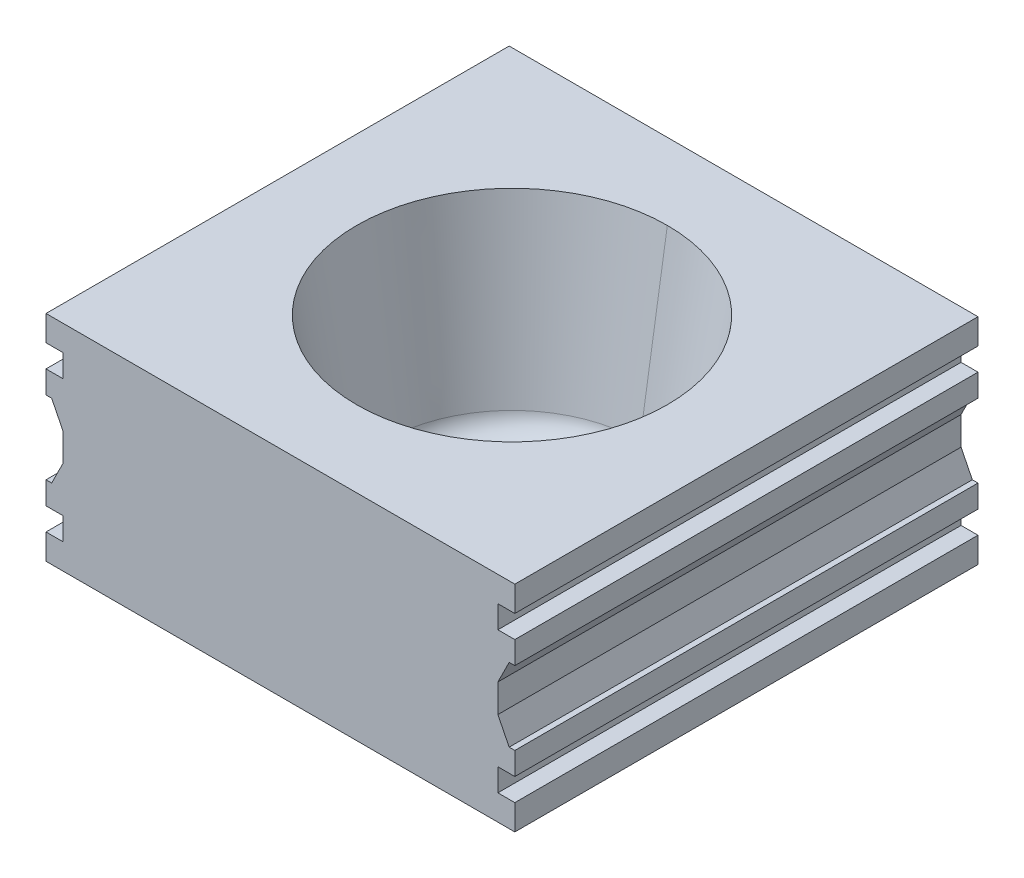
ISO-10303-21;
HEADER;
FILE_DESCRIPTION(('STEP AP214'),'2;1');
FILE_NAME('part.step','',(''),(''),'','','');
FILE_SCHEMA(('AUTOMOTIVE_DESIGN { 1 0 10303 214 1 1 1 1 }'));
ENDSEC;
DATA;
#1=APPLICATION_CONTEXT('core data for automotive mechanical design processes');
#2=APPLICATION_PROTOCOL_DEFINITION('international standard','automotive_design',2000,#1);
#3=PRODUCT_CONTEXT('',#1,'mechanical');
#4=PRODUCT('Part','Part','',(#3));
#5=PRODUCT_RELATED_PRODUCT_CATEGORY('part','',(#4));
#6=PRODUCT_DEFINITION_FORMATION('','',#4);
#7=PRODUCT_DEFINITION_CONTEXT('part definition',#1,'design');
#8=PRODUCT_DEFINITION('design','',#6,#7);
#9=PRODUCT_DEFINITION_SHAPE('','',#8);
#10=(LENGTH_UNIT() NAMED_UNIT(*) SI_UNIT(.MILLI.,.METRE.));
#11=(NAMED_UNIT(*) PLANE_ANGLE_UNIT() SI_UNIT($,.RADIAN.));
#12=(NAMED_UNIT(*) SI_UNIT($,.STERADIAN.) SOLID_ANGLE_UNIT());
#13=UNCERTAINTY_MEASURE_WITH_UNIT(LENGTH_MEASURE(1.E-05),#10,'distance_accuracy_value','');
#14=(GEOMETRIC_REPRESENTATION_CONTEXT(3) GLOBAL_UNCERTAINTY_ASSIGNED_CONTEXT((#13)) GLOBAL_UNIT_ASSIGNED_CONTEXT((#10,
#11,#12)) REPRESENTATION_CONTEXT('',''));
#15=CARTESIAN_POINT('',(0.,0.,0.));
#16=DIRECTION('',(0.,0.,1.));
#17=DIRECTION('',(1.,0.,0.));
#18=AXIS2_PLACEMENT_3D('',#15,#16,#17);
#19=CARTESIAN_POINT('',(6.,0.2,-17.));
#20=DIRECTION('',(0.,1.,0.));
#21=DIRECTION('',(1.,0.,0.));
#22=AXIS2_PLACEMENT_3D('',#19,#20,#21);
#23=PLANE('',#22);
#24=CARTESIAN_POINT('',(6.,0.2,-17.));
#25=DIRECTION('',(0.,-1.,0.));
#26=DIRECTION('',(0.,0.,1.));
#27=AXIS2_PLACEMENT_3D('',#24,#25,#26);
#28=CIRCLE('',#27,0.5);
#29=CARTESIAN_POINT('',(6.5,0.2,-17.));
#30=VERTEX_POINT('',#29);
#31=CARTESIAN_POINT('',(6.,0.2,-16.5));
#32=VERTEX_POINT('',#31);
#33=EDGE_CURVE('E343',#30,#32,#28,.T.);
#34=ORIENTED_EDGE('',*,*,#33,.T.);
#35=DIRECTION('',(-1.,0.,0.));
#36=VECTOR('',#35,1.);
#37=CARTESIAN_POINT('',(-6.,0.2,-16.5));
#38=LINE('',#37,#36);
#39=CARTESIAN_POINT('',(-6.,0.2,-16.5));
#40=VERTEX_POINT('',#39);
#41=EDGE_CURVE('E9',#32,#40,#38,.T.);
#42=ORIENTED_EDGE('',*,*,#41,.T.);
#43=CARTESIAN_POINT('',(-6.,0.2,-17.));
#44=DIRECTION('',(0.,-1.,0.));
#45=DIRECTION('',(0.,0.,1.));
#46=AXIS2_PLACEMENT_3D('',#43,#44,#45);
#47=CIRCLE('',#46,0.5);
#48=CARTESIAN_POINT('',(-6.5,0.2,-17.));
#49=VERTEX_POINT('',#48);
#50=EDGE_CURVE('E387',#40,#49,#47,.T.);
#51=ORIENTED_EDGE('',*,*,#50,.T.);
#52=DIRECTION('',(0.,0.,-1.));
#53=VECTOR('',#52,1.);
#54=CARTESIAN_POINT('',(-6.5,0.2,-19.));
#55=LINE('',#54,#53);
#56=CARTESIAN_POINT('',(-6.5,0.2,-19.));
#57=VERTEX_POINT('',#56);
#58=EDGE_CURVE('E380',#49,#57,#55,.T.);
#59=ORIENTED_EDGE('',*,*,#58,.T.);
#60=CARTESIAN_POINT('',(-6.,0.2,-19.));
#61=DIRECTION('',(0.,-1.,0.));
#62=DIRECTION('',(0.,0.,1.));
#63=AXIS2_PLACEMENT_3D('',#60,#61,#62);
#64=CIRCLE('',#63,0.5);
#65=CARTESIAN_POINT('',(-6.,0.2,-19.5));
#66=VERTEX_POINT('',#65);
#67=EDGE_CURVE('E372',#57,#66,#64,.T.);
#68=ORIENTED_EDGE('',*,*,#67,.T.);
#69=DIRECTION('',(1.,0.,0.));
#70=VECTOR('',#69,1.);
#71=CARTESIAN_POINT('',(-6.,0.2,-19.5));
#72=LINE('',#71,#70);
#73=CARTESIAN_POINT('',(6.,0.2,-19.5));
#74=VERTEX_POINT('',#73);
#75=EDGE_CURVE('E364',#66,#74,#72,.T.);
#76=ORIENTED_EDGE('',*,*,#75,.T.);
#77=CARTESIAN_POINT('',(6.,0.2,-19.));
#78=DIRECTION('',(0.,-1.,0.));
#79=DIRECTION('',(0.,0.,-1.));
#80=AXIS2_PLACEMENT_3D('',#77,#78,#79);
#81=CIRCLE('',#80,0.5);
#82=CARTESIAN_POINT('',(6.5,0.2,-19.));
#83=VERTEX_POINT('',#82);
#84=EDGE_CURVE('E356',#74,#83,#81,.T.);
#85=ORIENTED_EDGE('',*,*,#84,.T.);
#86=DIRECTION('',(0.,0.,1.));
#87=VECTOR('',#86,1.);
#88=CARTESIAN_POINT('',(6.5,0.2,-19.));
#89=LINE('',#88,#87);
#90=EDGE_CURVE('E349',#83,#30,#89,.T.);
#91=ORIENTED_EDGE('',*,*,#90,.T.);
#92=EDGE_LOOP('',(#34,#42,#51,#59,#68,#76,#85,#91));
#93=FACE_BOUND('',#92,.T.);
#94=ADVANCED_FACE('F15',(#93),#23,.F.);
#95=CARTESIAN_POINT('',(-6.,0.2,-16.5));
#96=DIRECTION('',(0.,0.,1.));
#97=DIRECTION('',(1.,0.,0.));
#98=AXIS2_PLACEMENT_3D('',#95,#96,#97);
#99=PLANE('',#98);
#100=DIRECTION('',(-1.,0.,0.));
#101=VECTOR('',#100,1.);
#102=CARTESIAN_POINT('',(-6.,0.,-16.5));
#103=LINE('',#102,#101);
#104=CARTESIAN_POINT('',(6.,0.,-16.5));
#105=VERTEX_POINT('',#104);
#106=CARTESIAN_POINT('',(-6.,0.,-16.5));
#107=VERTEX_POINT('',#106);
#108=EDGE_CURVE('E406',#105,#107,#103,.T.);
#109=ORIENTED_EDGE('',*,*,#108,.T.);
#110=DIRECTION('',(0.,-1.,0.));
#111=VECTOR('',#110,1.);
#112=CARTESIAN_POINT('',(-6.,0.2,-16.5));
#113=LINE('',#112,#111);
#114=EDGE_CURVE('E24',#40,#107,#113,.T.);
#115=ORIENTED_EDGE('',*,*,#114,.F.);
#116=ORIENTED_EDGE('',*,*,#41,.F.);
#117=DIRECTION('',(0.,-1.,0.));
#118=VECTOR('',#117,1.);
#119=CARTESIAN_POINT('',(6.,0.2,-16.5));
#120=LINE('',#119,#118);
#121=EDGE_CURVE('E175',#32,#105,#120,.T.);
#122=ORIENTED_EDGE('',*,*,#121,.T.);
#123=EDGE_LOOP('',(#109,#115,#116,#122));
#124=FACE_BOUND('',#123,.T.);
#125=ADVANCED_FACE('F407',(#124),#99,.F.);
#126=CARTESIAN_POINT('',(-6.,0.2,-17.));
#127=DIRECTION('',(0.,-1.,0.));
#128=DIRECTION('',(0.,0.,-1.));
#129=AXIS2_PLACEMENT_3D('',#126,#127,#128);
#130=CYLINDRICAL_SURFACE('',#129,0.5);
#131=CARTESIAN_POINT('',(-6.,0.,-17.));
#132=DIRECTION('',(0.,-1.,0.));
#133=DIRECTION('',(0.,0.,1.));
#134=AXIS2_PLACEMENT_3D('',#131,#132,#133);
#135=CIRCLE('',#134,0.5);
#136=CARTESIAN_POINT('',(-6.5,0.,-17.));
#137=VERTEX_POINT('',#136);
#138=EDGE_CURVE('E400',#107,#137,#135,.T.);
#139=ORIENTED_EDGE('',*,*,#138,.T.);
#140=DIRECTION('',(0.,-1.,0.));
#141=VECTOR('',#140,1.);
#142=CARTESIAN_POINT('',(-6.5,0.2,-17.));
#143=LINE('',#142,#141);
#144=EDGE_CURVE('E383',#49,#137,#143,.T.);
#145=ORIENTED_EDGE('',*,*,#144,.F.);
#146=ORIENTED_EDGE('',*,*,#50,.F.);
#147=ORIENTED_EDGE('',*,*,#114,.T.);
#148=EDGE_LOOP('',(#139,#145,#146,#147));
#149=FACE_BOUND('',#148,.T.);
#150=ADVANCED_FACE('F396',(#149),#130,.F.);
#151=CARTESIAN_POINT('',(-6.5,0.2,-19.));
#152=DIRECTION('',(-1.,0.,0.));
#153=DIRECTION('',(0.,0.,1.));
#154=AXIS2_PLACEMENT_3D('',#151,#152,#153);
#155=PLANE('',#154);
#156=DIRECTION('',(0.,0.,-1.));
#157=VECTOR('',#156,1.);
#158=CARTESIAN_POINT('',(-6.5,0.,-19.));
#159=LINE('',#158,#157);
#160=CARTESIAN_POINT('',(-6.5,0.,-19.));
#161=VERTEX_POINT('',#160);
#162=EDGE_CURVE('E418',#137,#161,#159,.T.);
#163=ORIENTED_EDGE('',*,*,#162,.T.);
#164=DIRECTION('',(0.,-1.,0.));
#165=VECTOR('',#164,1.);
#166=CARTESIAN_POINT('',(-6.5,0.2,-19.));
#167=LINE('',#166,#165);
#168=EDGE_CURVE('E376',#57,#161,#167,.T.);
#169=ORIENTED_EDGE('',*,*,#168,.F.);
#170=ORIENTED_EDGE('',*,*,#58,.F.);
#171=ORIENTED_EDGE('',*,*,#144,.T.);
#172=EDGE_LOOP('',(#163,#169,#170,#171));
#173=FACE_BOUND('',#172,.T.);
#174=ADVANCED_FACE('F1232',(#173),#155,.F.);
#175=CARTESIAN_POINT('',(-6.,0.2,-19.));
#176=DIRECTION('',(0.,-1.,0.));
#177=DIRECTION('',(0.,0.,-1.));
#178=AXIS2_PLACEMENT_3D('',#175,#176,#177);
#179=CYLINDRICAL_SURFACE('',#178,0.5);
#180=CARTESIAN_POINT('',(-6.,0.,-19.));
#181=DIRECTION('',(0.,-1.,0.));
#182=DIRECTION('',(0.,0.,1.));
#183=AXIS2_PLACEMENT_3D('',#180,#181,#182);
#184=CIRCLE('',#183,0.5);
#185=CARTESIAN_POINT('',(-6.,0.,-19.5));
#186=VERTEX_POINT('',#185);
#187=EDGE_CURVE('E424',#161,#186,#184,.T.);
#188=ORIENTED_EDGE('',*,*,#187,.T.);
#189=DIRECTION('',(0.,-1.,0.));
#190=VECTOR('',#189,1.);
#191=CARTESIAN_POINT('',(-6.,0.2,-19.5));
#192=LINE('',#191,#190);
#193=EDGE_CURVE('E368',#66,#186,#192,.T.);
#194=ORIENTED_EDGE('',*,*,#193,.F.);
#195=ORIENTED_EDGE('',*,*,#67,.F.);
#196=ORIENTED_EDGE('',*,*,#168,.T.);
#197=EDGE_LOOP('',(#188,#194,#195,#196));
#198=FACE_BOUND('',#197,.T.);
#199=ADVANCED_FACE('F1227',(#198),#179,.F.);
#200=CARTESIAN_POINT('',(-6.,0.2,-19.5));
#201=DIRECTION('',(0.,0.,-1.));
#202=DIRECTION('',(0.,-1.,0.));
#203=AXIS2_PLACEMENT_3D('',#200,#201,#202);
#204=PLANE('',#203);
#205=DIRECTION('',(1.,0.,0.));
#206=VECTOR('',#205,1.);
#207=CARTESIAN_POINT('',(-6.,0.,-19.5));
#208=LINE('',#207,#206);
#209=CARTESIAN_POINT('',(6.,0.,-19.5));
#210=VERTEX_POINT('',#209);
#211=EDGE_CURVE('E905',#186,#210,#208,.T.);
#212=ORIENTED_EDGE('',*,*,#211,.T.);
#213=DIRECTION('',(0.,-1.,0.));
#214=VECTOR('',#213,1.);
#215=CARTESIAN_POINT('',(6.,0.2,-19.5));
#216=LINE('',#215,#214);
#217=EDGE_CURVE('E360',#74,#210,#216,.T.);
#218=ORIENTED_EDGE('',*,*,#217,.F.);
#219=ORIENTED_EDGE('',*,*,#75,.F.);
#220=ORIENTED_EDGE('',*,*,#193,.T.);
#221=EDGE_LOOP('',(#212,#218,#219,#220));
#222=FACE_BOUND('',#221,.T.);
#223=ADVANCED_FACE('F1224',(#222),#204,.F.);
#224=CARTESIAN_POINT('',(6.,0.2,-19.));
#225=DIRECTION('',(0.,-1.,0.));
#226=DIRECTION('',(0.,0.,-1.));
#227=AXIS2_PLACEMENT_3D('',#224,#225,#226);
#228=CYLINDRICAL_SURFACE('',#227,0.5);
#229=CARTESIAN_POINT('',(6.,0.,-19.));
#230=DIRECTION('',(0.,-1.,0.));
#231=DIRECTION('',(0.,0.,-1.));
#232=AXIS2_PLACEMENT_3D('',#229,#230,#231);
#233=CIRCLE('',#232,0.5);
#234=CARTESIAN_POINT('',(6.5,0.,-19.));
#235=VERTEX_POINT('',#234);
#236=EDGE_CURVE('E909',#210,#235,#233,.T.);
#237=ORIENTED_EDGE('',*,*,#236,.T.);
#238=DIRECTION('',(0.,-1.,0.));
#239=VECTOR('',#238,1.);
#240=CARTESIAN_POINT('',(6.5,0.2,-19.));
#241=LINE('',#240,#239);
#242=EDGE_CURVE('E352',#83,#235,#241,.T.);
#243=ORIENTED_EDGE('',*,*,#242,.F.);
#244=ORIENTED_EDGE('',*,*,#84,.F.);
#245=ORIENTED_EDGE('',*,*,#217,.T.);
#246=EDGE_LOOP('',(#237,#243,#244,#245));
#247=FACE_BOUND('',#246,.T.);
#248=ADVANCED_FACE('F1220',(#247),#228,.F.);
#249=CARTESIAN_POINT('',(6.5,0.2,-19.));
#250=DIRECTION('',(1.,0.,0.));
#251=DIRECTION('',(0.,1.,0.));
#252=AXIS2_PLACEMENT_3D('',#249,#250,#251);
#253=PLANE('',#252);
#254=DIRECTION('',(0.,0.,1.));
#255=VECTOR('',#254,1.);
#256=CARTESIAN_POINT('',(6.5,0.,-19.));
#257=LINE('',#256,#255);
#258=CARTESIAN_POINT('',(6.5,0.,-17.));
#259=VERTEX_POINT('',#258);
#260=EDGE_CURVE('E551',#235,#259,#257,.T.);
#261=ORIENTED_EDGE('',*,*,#260,.T.);
#262=DIRECTION('',(0.,-1.,0.));
#263=VECTOR('',#262,1.);
#264=CARTESIAN_POINT('',(6.5,0.2,-17.));
#265=LINE('',#264,#263);
#266=EDGE_CURVE('E346',#30,#259,#265,.T.);
#267=ORIENTED_EDGE('',*,*,#266,.F.);
#268=ORIENTED_EDGE('',*,*,#90,.F.);
#269=ORIENTED_EDGE('',*,*,#242,.T.);
#270=EDGE_LOOP('',(#261,#267,#268,#269));
#271=FACE_BOUND('',#270,.T.);
#272=ADVANCED_FACE('F1216',(#271),#253,.F.);
#273=CARTESIAN_POINT('',(6.,0.2,-17.));
#274=DIRECTION('',(0.,-1.,0.));
#275=DIRECTION('',(0.,0.,-1.));
#276=AXIS2_PLACEMENT_3D('',#273,#274,#275);
#277=CYLINDRICAL_SURFACE('',#276,0.5);
#278=CARTESIAN_POINT('',(6.,0.,-17.));
#279=DIRECTION('',(0.,-1.,0.));
#280=DIRECTION('',(0.,0.,1.));
#281=AXIS2_PLACEMENT_3D('',#278,#279,#280);
#282=CIRCLE('',#281,0.5);
#283=EDGE_CURVE('E243',#259,#105,#282,.T.);
#284=ORIENTED_EDGE('',*,*,#283,.T.);
#285=ORIENTED_EDGE('',*,*,#121,.F.);
#286=ORIENTED_EDGE('',*,*,#33,.F.);
#287=ORIENTED_EDGE('',*,*,#266,.T.);
#288=EDGE_LOOP('',(#284,#285,#286,#287));
#289=FACE_BOUND('',#288,.T.);
#290=ADVANCED_FACE('F1211',(#289),#277,.F.);
#291=CARTESIAN_POINT('',(-6.,0.2,19.));
#292=DIRECTION('',(0.,-1.,0.));
#293=DIRECTION('',(0.,0.,-1.));
#294=AXIS2_PLACEMENT_3D('',#291,#292,#293);
#295=PLANE('',#294);
#296=CARTESIAN_POINT('',(-6.,0.2,19.));
#297=DIRECTION('',(0.,-1.,0.));
#298=DIRECTION('',(0.,0.,-1.));
#299=AXIS2_PLACEMENT_3D('',#296,#297,#298);
#300=CIRCLE('',#299,0.5);
#301=CARTESIAN_POINT('',(-6.,0.2,19.5));
#302=VERTEX_POINT('',#301);
#303=CARTESIAN_POINT('',(-6.5,0.2,19.));
#304=VERTEX_POINT('',#303);
#305=EDGE_CURVE('E171',#302,#304,#300,.T.);
#306=ORIENTED_EDGE('',*,*,#305,.T.);
#307=DIRECTION('',(0.,0.,-1.));
#308=VECTOR('',#307,1.);
#309=CARTESIAN_POINT('',(-6.5,0.2,19.));
#310=LINE('',#309,#308);
#311=CARTESIAN_POINT('',(-6.5,0.2,17.));
#312=VERTEX_POINT('',#311);
#313=EDGE_CURVE('E163',#304,#312,#310,.T.);
#314=ORIENTED_EDGE('',*,*,#313,.T.);
#315=CARTESIAN_POINT('',(-6.,0.2,17.));
#316=DIRECTION('',(0.,-1.,0.));
#317=DIRECTION('',(0.,0.,-1.));
#318=AXIS2_PLACEMENT_3D('',#315,#316,#317);
#319=CIRCLE('',#318,0.5);
#320=CARTESIAN_POINT('',(-6.,0.2,16.5));
#321=VERTEX_POINT('',#320);
#322=EDGE_CURVE('E168',#312,#321,#319,.T.);
#323=ORIENTED_EDGE('',*,*,#322,.T.);
#324=DIRECTION('',(1.,0.,0.));
#325=VECTOR('',#324,1.);
#326=CARTESIAN_POINT('',(-6.,0.2,16.5));
#327=LINE('',#326,#325);
#328=CARTESIAN_POINT('',(6.,0.2,16.5));
#329=VERTEX_POINT('',#328);
#330=EDGE_CURVE('E195',#321,#329,#327,.T.);
#331=ORIENTED_EDGE('',*,*,#330,.T.);
#332=CARTESIAN_POINT('',(6.,0.2,17.));
#333=DIRECTION('',(0.,-1.,0.));
#334=DIRECTION('',(0.,0.,-1.));
#335=AXIS2_PLACEMENT_3D('',#332,#333,#334);
#336=CIRCLE('',#335,0.5);
#337=CARTESIAN_POINT('',(6.5,0.2,17.));
#338=VERTEX_POINT('',#337);
#339=EDGE_CURVE('E333',#329,#338,#336,.T.);
#340=ORIENTED_EDGE('',*,*,#339,.T.);
#341=DIRECTION('',(0.,0.,1.));
#342=VECTOR('',#341,1.);
#343=CARTESIAN_POINT('',(6.5,0.2,19.));
#344=LINE('',#343,#342);
#345=CARTESIAN_POINT('',(6.5,0.2,19.));
#346=VERTEX_POINT('',#345);
#347=EDGE_CURVE('E327',#338,#346,#344,.T.);
#348=ORIENTED_EDGE('',*,*,#347,.T.);
#349=CARTESIAN_POINT('',(6.,0.2,19.));
#350=DIRECTION('',(0.,-1.,0.));
#351=DIRECTION('',(0.,0.,1.));
#352=AXIS2_PLACEMENT_3D('',#349,#350,#351);
#353=CIRCLE('',#352,0.5);
#354=CARTESIAN_POINT('',(6.,0.2,19.5));
#355=VERTEX_POINT('',#354);
#356=EDGE_CURVE('E320',#346,#355,#353,.T.);
#357=ORIENTED_EDGE('',*,*,#356,.T.);
#358=DIRECTION('',(-1.,0.,0.));
#359=VECTOR('',#358,1.);
#360=CARTESIAN_POINT('',(-6.,0.2,19.5));
#361=LINE('',#360,#359);
#362=EDGE_CURVE('E314',#355,#302,#361,.T.);
#363=ORIENTED_EDGE('',*,*,#362,.T.);
#364=EDGE_LOOP('',(#306,#314,#323,#331,#340,#348,#357,#363));
#365=FACE_BOUND('',#364,.T.);
#366=ADVANCED_FACE('F165',(#365),#295,.T.);
#367=CARTESIAN_POINT('',(-6.5,0.2,19.));
#368=DIRECTION('',(-1.,0.,0.));
#369=DIRECTION('',(0.,0.,1.));
#370=AXIS2_PLACEMENT_3D('',#367,#368,#369);
#371=PLANE('',#370);
#372=DIRECTION('',(0.,0.,-1.));
#373=VECTOR('',#372,1.);
#374=CARTESIAN_POINT('',(-6.5,0.,19.));
#375=LINE('',#374,#373);
#376=CARTESIAN_POINT('',(-6.5,0.,19.));
#377=VERTEX_POINT('',#376);
#378=CARTESIAN_POINT('',(-6.5,0.,17.));
#379=VERTEX_POINT('',#378);
#380=EDGE_CURVE('E181',#377,#379,#375,.T.);
#381=ORIENTED_EDGE('',*,*,#380,.T.);
#382=DIRECTION('',(0.,-1.,0.));
#383=VECTOR('',#382,1.);
#384=CARTESIAN_POINT('',(-6.5,0.2,17.));
#385=LINE('',#384,#383);
#386=EDGE_CURVE('E176',#312,#379,#385,.T.);
#387=ORIENTED_EDGE('',*,*,#386,.F.);
#388=ORIENTED_EDGE('',*,*,#313,.F.);
#389=DIRECTION('',(0.,-1.,0.));
#390=VECTOR('',#389,1.);
#391=CARTESIAN_POINT('',(-6.5,0.2,19.));
#392=LINE('',#391,#390);
#393=EDGE_CURVE('E305',#304,#377,#392,.T.);
#394=ORIENTED_EDGE('',*,*,#393,.T.);
#395=EDGE_LOOP('',(#381,#387,#388,#394));
#396=FACE_BOUND('',#395,.T.);
#397=ADVANCED_FACE('F179',(#396),#371,.F.);
#398=CARTESIAN_POINT('',(-6.,0.2,17.));
#399=DIRECTION('',(0.,-1.,0.));
#400=DIRECTION('',(0.,0.,-1.));
#401=AXIS2_PLACEMENT_3D('',#398,#399,#400);
#402=CYLINDRICAL_SURFACE('',#401,0.5);
#403=CARTESIAN_POINT('',(-6.,0.,17.));
#404=DIRECTION('',(0.,-1.,0.));
#405=DIRECTION('',(0.,0.,-1.));
#406=AXIS2_PLACEMENT_3D('',#403,#404,#405);
#407=CIRCLE('',#406,0.5);
#408=CARTESIAN_POINT('',(-6.,0.,16.5));
#409=VERTEX_POINT('',#408);
#410=EDGE_CURVE('E201',#379,#409,#407,.T.);
#411=ORIENTED_EDGE('',*,*,#410,.T.);
#412=DIRECTION('',(0.,-1.,0.));
#413=VECTOR('',#412,1.);
#414=CARTESIAN_POINT('',(-6.,0.2,16.5));
#415=LINE('',#414,#413);
#416=EDGE_CURVE('E188',#321,#409,#415,.T.);
#417=ORIENTED_EDGE('',*,*,#416,.F.);
#418=ORIENTED_EDGE('',*,*,#322,.F.);
#419=ORIENTED_EDGE('',*,*,#386,.T.);
#420=EDGE_LOOP('',(#411,#417,#418,#419));
#421=FACE_BOUND('',#420,.T.);
#422=ADVANCED_FACE('F187',(#421),#402,.F.);
#423=CARTESIAN_POINT('',(-6.,0.2,16.5));
#424=DIRECTION('',(0.,0.,-1.));
#425=DIRECTION('',(0.,-1.,0.));
#426=AXIS2_PLACEMENT_3D('',#423,#424,#425);
#427=PLANE('',#426);
#428=DIRECTION('',(1.,0.,0.));
#429=VECTOR('',#428,1.);
#430=CARTESIAN_POINT('',(-6.,0.,16.5));
#431=LINE('',#430,#429);
#432=CARTESIAN_POINT('',(6.,0.,16.5));
#433=VERTEX_POINT('',#432);
#434=EDGE_CURVE('E203',#409,#433,#431,.T.);
#435=ORIENTED_EDGE('',*,*,#434,.T.);
#436=DIRECTION('',(0.,-1.,0.));
#437=VECTOR('',#436,1.);
#438=CARTESIAN_POINT('',(6.,0.2,16.5));
#439=LINE('',#438,#437);
#440=EDGE_CURVE('E337',#329,#433,#439,.T.);
#441=ORIENTED_EDGE('',*,*,#440,.F.);
#442=ORIENTED_EDGE('',*,*,#330,.F.);
#443=ORIENTED_EDGE('',*,*,#416,.T.);
#444=EDGE_LOOP('',(#435,#441,#442,#443));
#445=FACE_BOUND('',#444,.T.);
#446=ADVANCED_FACE('F600',(#445),#427,.F.);
#447=CARTESIAN_POINT('',(6.,0.2,17.));
#448=DIRECTION('',(0.,-1.,0.));
#449=DIRECTION('',(0.,0.,-1.));
#450=AXIS2_PLACEMENT_3D('',#447,#448,#449);
#451=CYLINDRICAL_SURFACE('',#450,0.5);
#452=CARTESIAN_POINT('',(6.,0.,17.));
#453=DIRECTION('',(0.,-1.,0.));
#454=DIRECTION('',(0.,0.,-1.));
#455=AXIS2_PLACEMENT_3D('',#452,#453,#454);
#456=CIRCLE('',#455,0.5);
#457=CARTESIAN_POINT('',(6.5,0.,17.));
#458=VERTEX_POINT('',#457);
#459=EDGE_CURVE('E587',#433,#458,#456,.T.);
#460=ORIENTED_EDGE('',*,*,#459,.T.);
#461=DIRECTION('',(0.,-1.,0.));
#462=VECTOR('',#461,1.);
#463=CARTESIAN_POINT('',(6.5,0.2,17.));
#464=LINE('',#463,#462);
#465=EDGE_CURVE('E330',#338,#458,#464,.T.);
#466=ORIENTED_EDGE('',*,*,#465,.F.);
#467=ORIENTED_EDGE('',*,*,#339,.F.);
#468=ORIENTED_EDGE('',*,*,#440,.T.);
#469=EDGE_LOOP('',(#460,#466,#467,#468));
#470=FACE_BOUND('',#469,.T.);
#471=ADVANCED_FACE('F609',(#470),#451,.F.);
#472=CARTESIAN_POINT('',(6.5,0.2,19.));
#473=DIRECTION('',(1.,0.,0.));
#474=DIRECTION('',(0.,1.,0.));
#475=AXIS2_PLACEMENT_3D('',#472,#473,#474);
#476=PLANE('',#475);
#477=DIRECTION('',(0.,0.,1.));
#478=VECTOR('',#477,1.);
#479=CARTESIAN_POINT('',(6.5,0.,19.));
#480=LINE('',#479,#478);
#481=CARTESIAN_POINT('',(6.5,0.,19.));
#482=VERTEX_POINT('',#481);
#483=EDGE_CURVE('E591',#458,#482,#480,.T.);
#484=ORIENTED_EDGE('',*,*,#483,.T.);
#485=DIRECTION('',(0.,-1.,0.));
#486=VECTOR('',#485,1.);
#487=CARTESIAN_POINT('',(6.5,0.2,19.));
#488=LINE('',#487,#486);
#489=EDGE_CURVE('E324',#346,#482,#488,.T.);
#490=ORIENTED_EDGE('',*,*,#489,.F.);
#491=ORIENTED_EDGE('',*,*,#347,.F.);
#492=ORIENTED_EDGE('',*,*,#465,.T.);
#493=EDGE_LOOP('',(#484,#490,#491,#492));
#494=FACE_BOUND('',#493,.T.);
#495=ADVANCED_FACE('F1251',(#494),#476,.F.);
#496=CARTESIAN_POINT('',(6.,0.2,19.));
#497=DIRECTION('',(0.,-1.,0.));
#498=DIRECTION('',(0.,0.,-1.));
#499=AXIS2_PLACEMENT_3D('',#496,#497,#498);
#500=CYLINDRICAL_SURFACE('',#499,0.5);
#501=CARTESIAN_POINT('',(6.,0.,19.));
#502=DIRECTION('',(0.,-1.,0.));
#503=DIRECTION('',(0.,0.,1.));
#504=AXIS2_PLACEMENT_3D('',#501,#502,#503);
#505=CIRCLE('',#504,0.5);
#506=CARTESIAN_POINT('',(6.,0.,19.5));
#507=VERTEX_POINT('',#506);
#508=EDGE_CURVE('E249',#482,#507,#505,.T.);
#509=ORIENTED_EDGE('',*,*,#508,.T.);
#510=DIRECTION('',(0.,-1.,0.));
#511=VECTOR('',#510,1.);
#512=CARTESIAN_POINT('',(6.,0.2,19.5));
#513=LINE('',#512,#511);
#514=EDGE_CURVE('E317',#355,#507,#513,.T.);
#515=ORIENTED_EDGE('',*,*,#514,.F.);
#516=ORIENTED_EDGE('',*,*,#356,.F.);
#517=ORIENTED_EDGE('',*,*,#489,.T.);
#518=EDGE_LOOP('',(#509,#515,#516,#517));
#519=FACE_BOUND('',#518,.T.);
#520=ADVANCED_FACE('F1254',(#519),#500,.F.);
#521=CARTESIAN_POINT('',(-6.,0.2,19.5));
#522=DIRECTION('',(0.,0.,1.));
#523=DIRECTION('',(1.,0.,0.));
#524=AXIS2_PLACEMENT_3D('',#521,#522,#523);
#525=PLANE('',#524);
#526=DIRECTION('',(-1.,0.,0.));
#527=VECTOR('',#526,1.);
#528=CARTESIAN_POINT('',(-6.,0.,19.5));
#529=LINE('',#528,#527);
#530=CARTESIAN_POINT('',(-6.,0.,19.5));
#531=VERTEX_POINT('',#530);
#532=EDGE_CURVE('E245',#507,#531,#529,.T.);
#533=ORIENTED_EDGE('',*,*,#532,.T.);
#534=DIRECTION('',(0.,-1.,0.));
#535=VECTOR('',#534,1.);
#536=CARTESIAN_POINT('',(-6.,0.2,19.5));
#537=LINE('',#536,#535);
#538=EDGE_CURVE('E310',#302,#531,#537,.T.);
#539=ORIENTED_EDGE('',*,*,#538,.F.);
#540=ORIENTED_EDGE('',*,*,#362,.F.);
#541=ORIENTED_EDGE('',*,*,#514,.T.);
#542=EDGE_LOOP('',(#533,#539,#540,#541));
#543=FACE_BOUND('',#542,.T.);
#544=ADVANCED_FACE('F1258',(#543),#525,.F.);
#545=CARTESIAN_POINT('',(-6.,0.2,19.));
#546=DIRECTION('',(0.,-1.,0.));
#547=DIRECTION('',(0.,0.,-1.));
#548=AXIS2_PLACEMENT_3D('',#545,#546,#547);
#549=CYLINDRICAL_SURFACE('',#548,0.5);
#550=CARTESIAN_POINT('',(-6.,0.,19.));
#551=DIRECTION('',(0.,-1.,0.));
#552=DIRECTION('',(0.,0.,-1.));
#553=AXIS2_PLACEMENT_3D('',#550,#551,#552);
#554=CIRCLE('',#553,0.5);
#555=EDGE_CURVE('E250',#531,#377,#554,.T.);
#556=ORIENTED_EDGE('',*,*,#555,.T.);
#557=ORIENTED_EDGE('',*,*,#393,.F.);
#558=ORIENTED_EDGE('',*,*,#305,.F.);
#559=ORIENTED_EDGE('',*,*,#538,.T.);
#560=EDGE_LOOP('',(#556,#557,#558,#559));
#561=FACE_BOUND('',#560,.T.);
#562=ADVANCED_FACE('F1261',(#561),#549,.F.);
#563=CARTESIAN_POINT('',(0.,1.3,0.));
#564=DIRECTION('',(0.,-1.,0.));
#565=DIRECTION('',(0.,0.,-1.));
#566=AXIS2_PLACEMENT_3D('',#563,#564,#565);
#567=PLANE('',#566);
#568=CARTESIAN_POINT('',(0.,1.3,0.));
#569=DIRECTION('',(0.,1.,0.));
#570=DIRECTION('',(0.,0.,-1.));
#571=AXIS2_PLACEMENT_3D('',#568,#569,#570);
#572=CIRCLE('',#571,2.25);
#573=CARTESIAN_POINT('',(0.,1.3,-2.25));
#574=VERTEX_POINT('',#573);
#575=CARTESIAN_POINT('',(0.,1.3,2.25));
#576=VERTEX_POINT('',#575);
#577=EDGE_CURVE('E1034',#574,#576,#572,.T.);
#578=ORIENTED_EDGE('',*,*,#577,.T.);
#579=CARTESIAN_POINT('',(0.,1.3,0.));
#580=DIRECTION('',(0.,1.,0.));
#581=DIRECTION('',(0.,0.,-1.));
#582=AXIS2_PLACEMENT_3D('',#579,#580,#581);
#583=CIRCLE('',#582,2.25);
#584=EDGE_CURVE('E1021',#576,#574,#583,.T.);
#585=ORIENTED_EDGE('',*,*,#584,.T.);
#586=EDGE_LOOP('',(#578,#585));
#587=FACE_BOUND('',#586,.T.);
#588=ADVANCED_FACE('F1266',(#587),#567,.F.);
#589=CARTESIAN_POINT('',(0.,0.3,0.));
#590=DIRECTION('',(0.,-1.,0.));
#591=DIRECTION('',(0.,0.,-1.));
#592=AXIS2_PLACEMENT_3D('',#589,#590,#591);
#593=PLANE('',#592);
#594=CARTESIAN_POINT('',(0.,0.3,0.));
#595=DIRECTION('',(0.,-1.,0.));
#596=DIRECTION('',(0.,0.,-1.));
#597=AXIS2_PLACEMENT_3D('',#594,#595,#596);
#598=CIRCLE('',#597,2.25);
#599=CARTESIAN_POINT('',(0.,0.3,-2.25));
#600=VERTEX_POINT('',#599);
#601=CARTESIAN_POINT('',(0.,0.3,2.25));
#602=VERTEX_POINT('',#601);
#603=EDGE_CURVE('E301',#600,#602,#598,.T.);
#604=ORIENTED_EDGE('',*,*,#603,.T.);
#605=CARTESIAN_POINT('',(0.,0.3,0.));
#606=DIRECTION('',(0.,-1.,0.));
#607=DIRECTION('',(0.,0.,-1.));
#608=AXIS2_PLACEMENT_3D('',#605,#606,#607);
#609=CIRCLE('',#608,2.25);
#610=EDGE_CURVE('E1080',#602,#600,#609,.T.);
#611=ORIENTED_EDGE('',*,*,#610,.T.);
#612=EDGE_LOOP('',(#604,#611));
#613=FACE_BOUND('',#612,.T.);
#614=ADVANCED_FACE('F1270',(#613),#593,.T.);
#615=CARTESIAN_POINT('',(0.,4.,0.));
#616=DIRECTION('',(0.,1.,0.));
#617=DIRECTION('',(0.,0.,1.));
#618=AXIS2_PLACEMENT_3D('',#615,#616,#617);
#619=TOROIDAL_SURFACE('',#618,9.34930314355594,2.);
#620=CARTESIAN_POINT('',(0.,4.,-9.34930314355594));
#621=DIRECTION('',(1.,0.,0.));
#622=DIRECTION('',(0.,0.,-1.));
#623=AXIS2_PLACEMENT_3D('',#620,#621,#622);
#624=CIRCLE('',#623,2.);
#625=CARTESIAN_POINT('',(0.,2.,-9.34930314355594));
#626=VERTEX_POINT('',#625);
#627=CARTESIAN_POINT('',(0.,3.68713106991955,-11.3246798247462));
#628=VERTEX_POINT('',#627);
#629=EDGE_CURVE('E1097',#626,#628,#624,.T.);
#630=ORIENTED_EDGE('',*,*,#629,.F.);
#631=CARTESIAN_POINT('',(0.,2.,0.));
#632=DIRECTION('',(0.,1.,0.));
#633=DIRECTION('',(0.,0.,1.));
#634=AXIS2_PLACEMENT_3D('',#631,#632,#633);
#635=CIRCLE('',#634,9.34930314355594);
#636=CARTESIAN_POINT('',(0.,2.,9.34930314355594));
#637=VERTEX_POINT('',#636);
#638=EDGE_CURVE('E297',#637,#626,#635,.T.);
#639=ORIENTED_EDGE('',*,*,#638,.F.);
#640=CARTESIAN_POINT('',(0.,4.,9.34930314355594));
#641=DIRECTION('',(-1.,0.,0.));
#642=DIRECTION('',(0.,0.,1.));
#643=AXIS2_PLACEMENT_3D('',#640,#641,#642);
#644=CIRCLE('',#643,2.);
#645=CARTESIAN_POINT('',(0.,3.68713106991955,11.3246798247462));
#646=VERTEX_POINT('',#645);
#647=EDGE_CURVE('E1084',#637,#646,#644,.T.);
#648=ORIENTED_EDGE('',*,*,#647,.T.);
#649=CARTESIAN_POINT('',(0.,3.68713106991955,0.));
#650=DIRECTION('',(0.,-1.,0.));
#651=DIRECTION('',(0.,0.,-1.));
#652=AXIS2_PLACEMENT_3D('',#649,#650,#651);
#653=CIRCLE('',#652,11.3246798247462);
#654=EDGE_CURVE('E293',#628,#646,#653,.T.);
#655=ORIENTED_EDGE('',*,*,#654,.F.);
#656=EDGE_LOOP('',(#630,#639,#648,#655));
#657=FACE_BOUND('',#656,.T.);
#658=ADVANCED_FACE('F1274',(#657),#619,.F.);
#659=CARTESIAN_POINT('',(0.,17.,0.));
#660=DIRECTION('',(0.,-1.,0.));
#661=DIRECTION('',(0.,0.,-1.));
#662=AXIS2_PLACEMENT_3D('',#659,#660,#661);
#663=CYLINDRICAL_SURFACE('',#662,2.25);
#664=DIRECTION('',(0.,-1.,0.));
#665=VECTOR('',#664,1.);
#666=CARTESIAN_POINT('',(0.,17.,2.25));
#667=LINE('',#666,#665);
#668=CARTESIAN_POINT('',(0.,0.,2.25));
#669=VERTEX_POINT('',#668);
#670=EDGE_CURVE('E1076',#602,#669,#667,.T.);
#671=ORIENTED_EDGE('',*,*,#670,.F.);
#672=ORIENTED_EDGE('',*,*,#603,.F.);
#673=DIRECTION('',(0.,-1.,0.));
#674=VECTOR('',#673,1.);
#675=CARTESIAN_POINT('',(0.,17.,-2.25));
#676=LINE('',#675,#674);
#677=CARTESIAN_POINT('',(0.,0.,-2.25));
#678=VERTEX_POINT('',#677);
#679=EDGE_CURVE('E1067',#600,#678,#676,.T.);
#680=ORIENTED_EDGE('',*,*,#679,.T.);
#681=CARTESIAN_POINT('',(0.,0.,0.));
#682=DIRECTION('',(0.,-1.,0.));
#683=DIRECTION('',(0.,0.,-1.));
#684=AXIS2_PLACEMENT_3D('',#681,#682,#683);
#685=CIRCLE('',#684,2.25);
#686=EDGE_CURVE('E253',#678,#669,#685,.T.);
#687=ORIENTED_EDGE('',*,*,#686,.T.);
#688=EDGE_LOOP('',(#671,#672,#680,#687));
#689=FACE_BOUND('',#688,.T.);
#690=ADVANCED_FACE('F1278',(#689),#663,.F.);
#691=CARTESIAN_POINT('',(0.,2.,0.));
#692=DIRECTION('',(0.,1.,0.));
#693=DIRECTION('',(1.,0.,0.));
#694=AXIS2_PLACEMENT_3D('',#691,#692,#693);
#695=PLANE('',#694);
#696=CARTESIAN_POINT('',(0.,2.,0.));
#697=DIRECTION('',(0.,1.,0.));
#698=DIRECTION('',(0.,0.,1.));
#699=AXIS2_PLACEMENT_3D('',#696,#697,#698);
#700=CIRCLE('',#699,2.25);
#701=CARTESIAN_POINT('',(0.,2.,-2.25));
#702=VERTEX_POINT('',#701);
#703=CARTESIAN_POINT('',(0.,2.,2.25));
#704=VERTEX_POINT('',#703);
#705=EDGE_CURVE('E1044',#702,#704,#700,.T.);
#706=ORIENTED_EDGE('',*,*,#705,.F.);
#707=CARTESIAN_POINT('',(0.,2.,0.));
#708=DIRECTION('',(0.,1.,0.));
#709=DIRECTION('',(0.,0.,1.));
#710=AXIS2_PLACEMENT_3D('',#707,#708,#709);
#711=CIRCLE('',#710,2.25);
#712=EDGE_CURVE('E1026',#704,#702,#711,.T.);
#713=ORIENTED_EDGE('',*,*,#712,.F.);
#714=EDGE_LOOP('',(#706,#713));
#715=FACE_BOUND('',#714,.T.);
#716=ORIENTED_EDGE('',*,*,#638,.T.);
#717=CARTESIAN_POINT('',(0.,2.,0.));
#718=DIRECTION('',(0.,1.,0.));
#719=DIRECTION('',(0.,0.,1.));
#720=AXIS2_PLACEMENT_3D('',#717,#718,#719);
#721=CIRCLE('',#720,9.34930314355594);
#722=EDGE_CURVE('E1107',#626,#637,#721,.T.);
#723=ORIENTED_EDGE('',*,*,#722,.T.);
#724=EDGE_LOOP('',(#716,#723));
#725=FACE_BOUND('',#724,.T.);
#726=ADVANCED_FACE('F1282',(#715,#725),#695,.T.);
#727=CARTESIAN_POINT('',(0.,19.,0.));
#728=DIRECTION('',(0.,1.,0.));
#729=DIRECTION('',(0.,0.,1.));
#730=AXIS2_PLACEMENT_3D('',#727,#728,#729);
#731=CONICAL_SURFACE('',#730,13.75,0.15707963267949);
#732=DIRECTION('',(0.,0.987688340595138,-0.156434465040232));
#733=VECTOR('',#732,1.);
#734=CARTESIAN_POINT('',(0.,19.,-13.75));
#735=LINE('',#734,#733);
#736=CARTESIAN_POINT('',(0.,19.,-13.75));
#737=VERTEX_POINT('',#736);
#738=EDGE_CURVE('E1061',#628,#737,#735,.T.);
#739=ORIENTED_EDGE('',*,*,#738,.F.);
#740=ORIENTED_EDGE('',*,*,#654,.T.);
#741=DIRECTION('',(0.,0.987688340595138,0.156434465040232));
#742=VECTOR('',#741,1.);
#743=CARTESIAN_POINT('',(0.,19.,13.75));
#744=LINE('',#743,#742);
#745=CARTESIAN_POINT('',(0.,19.,13.75));
#746=VERTEX_POINT('',#745);
#747=EDGE_CURVE('E1050',#646,#746,#744,.T.);
#748=ORIENTED_EDGE('',*,*,#747,.T.);
#749=CARTESIAN_POINT('',(0.,19.,0.));
#750=DIRECTION('',(0.,1.,0.));
#751=DIRECTION('',(0.,0.,1.));
#752=AXIS2_PLACEMENT_3D('',#749,#750,#751);
#753=CIRCLE('',#752,13.75);
#754=EDGE_CURVE('E239',#746,#737,#753,.T.);
#755=ORIENTED_EDGE('',*,*,#754,.T.);
#756=EDGE_LOOP('',(#739,#740,#748,#755));
#757=FACE_BOUND('',#756,.T.);
#758=ADVANCED_FACE('F1286',(#757),#731,.F.);
#759=CARTESIAN_POINT('',(19.25,4.25,-25.));
#760=DIRECTION('',(0.,-1.,0.));
#761=DIRECTION('',(0.,0.,-1.));
#762=AXIS2_PLACEMENT_3D('',#759,#760,#761);
#763=PLANE('',#762);
#764=DIRECTION('',(-1.,0.,0.));
#765=VECTOR('',#764,1.);
#766=CARTESIAN_POINT('',(-20.75,4.24999999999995,20.5));
#767=LINE('',#766,#765);
#768=CARTESIAN_POINT('',(20.75,4.25,20.5));
#769=VERTEX_POINT('',#768);
#770=CARTESIAN_POINT('',(19.25,4.25,20.5));
#771=VERTEX_POINT('',#770);
#772=EDGE_CURVE('E999',#769,#771,#767,.T.);
#773=ORIENTED_EDGE('',*,*,#772,.T.);
#774=DIRECTION('',(0.,0.,1.));
#775=VECTOR('',#774,1.);
#776=CARTESIAN_POINT('',(19.25,4.25,-25.));
#777=LINE('',#776,#775);
#778=CARTESIAN_POINT('',(19.25,4.25,-20.5));
#779=VERTEX_POINT('',#778);
#780=EDGE_CURVE('E289',#779,#771,#777,.T.);
#781=ORIENTED_EDGE('',*,*,#780,.F.);
#782=DIRECTION('',(1.,0.,0.));
#783=VECTOR('',#782,1.);
#784=CARTESIAN_POINT('',(-20.75,4.24999999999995,-20.5));
#785=LINE('',#784,#783);
#786=CARTESIAN_POINT('',(20.75,4.25,-20.5));
#787=VERTEX_POINT('',#786);
#788=EDGE_CURVE('E213',#779,#787,#785,.T.);
#789=ORIENTED_EDGE('',*,*,#788,.T.);
#790=DIRECTION('',(0.,0.,1.));
#791=VECTOR('',#790,1.);
#792=CARTESIAN_POINT('',(20.75,4.25,-25.));
#793=LINE('',#792,#791);
#794=EDGE_CURVE('E486',#787,#769,#793,.T.);
#795=ORIENTED_EDGE('',*,*,#794,.T.);
#796=EDGE_LOOP('',(#773,#781,#789,#795));
#797=FACE_BOUND('',#796,.T.);
#798=ADVANCED_FACE('F1288',(#797),#763,.T.);
#799=CARTESIAN_POINT('',(19.25,2.25,-25.));
#800=DIRECTION('',(1.,0.,0.));
#801=DIRECTION('',(0.,-1.,0.));
#802=AXIS2_PLACEMENT_3D('',#799,#800,#801);
#803=PLANE('',#802);
#804=DIRECTION('',(0.,-1.,0.));
#805=VECTOR('',#804,1.);
#806=CARTESIAN_POINT('',(19.25,19.,20.5));
#807=LINE('',#806,#805);
#808=CARTESIAN_POINT('',(19.25,2.25,20.5));
#809=VERTEX_POINT('',#808);
#810=EDGE_CURVE('E1007',#771,#809,#807,.T.);
#811=ORIENTED_EDGE('',*,*,#810,.T.);
#812=DIRECTION('',(0.,0.,1.));
#813=VECTOR('',#812,1.);
#814=CARTESIAN_POINT('',(19.25,2.25,-25.));
#815=LINE('',#814,#813);
#816=CARTESIAN_POINT('',(19.25,2.25,-20.5));
#817=VERTEX_POINT('',#816);
#818=EDGE_CURVE('E285',#817,#809,#815,.T.);
#819=ORIENTED_EDGE('',*,*,#818,.F.);
#820=DIRECTION('',(0.,1.,0.));
#821=VECTOR('',#820,1.);
#822=CARTESIAN_POINT('',(19.25,19.,-20.5));
#823=LINE('',#822,#821);
#824=EDGE_CURVE('E217',#817,#779,#823,.T.);
#825=ORIENTED_EDGE('',*,*,#824,.T.);
#826=ORIENTED_EDGE('',*,*,#780,.T.);
#827=EDGE_LOOP('',(#811,#819,#825,#826));
#828=FACE_BOUND('',#827,.T.);
#829=ADVANCED_FACE('F1291',(#828),#803,.T.);
#830=CARTESIAN_POINT('',(20.75,2.25,-25.));
#831=DIRECTION('',(0.,1.,0.));
#832=DIRECTION('',(1.,0.,0.));
#833=AXIS2_PLACEMENT_3D('',#830,#831,#832);
#834=PLANE('',#833);
#835=DIRECTION('',(1.,0.,0.));
#836=VECTOR('',#835,1.);
#837=CARTESIAN_POINT('',(-20.75,2.25,20.5));
#838=LINE('',#837,#836);
#839=CARTESIAN_POINT('',(20.75,2.25,20.5));
#840=VERTEX_POINT('',#839);
#841=EDGE_CURVE('E1014',#809,#840,#838,.T.);
#842=ORIENTED_EDGE('',*,*,#841,.T.);
#843=DIRECTION('',(0.,0.,1.));
#844=VECTOR('',#843,1.);
#845=CARTESIAN_POINT('',(20.75,2.25,-25.));
#846=LINE('',#845,#844);
#847=CARTESIAN_POINT('',(20.75,2.25,-20.5));
#848=VERTEX_POINT('',#847);
#849=EDGE_CURVE('E474',#848,#840,#846,.T.);
#850=ORIENTED_EDGE('',*,*,#849,.F.);
#851=DIRECTION('',(-1.,0.,0.));
#852=VECTOR('',#851,1.);
#853=CARTESIAN_POINT('',(-20.75,2.25,-20.5));
#854=LINE('',#853,#852);
#855=EDGE_CURVE('E514',#848,#817,#854,.T.);
#856=ORIENTED_EDGE('',*,*,#855,.T.);
#857=ORIENTED_EDGE('',*,*,#818,.T.);
#858=EDGE_LOOP('',(#842,#850,#856,#857));
#859=FACE_BOUND('',#858,.T.);
#860=ADVANCED_FACE('F1295',(#859),#834,.T.);
#861=CARTESIAN_POINT('',(20.75,6.25,-25.));
#862=DIRECTION('',(0.,1.,0.));
#863=DIRECTION('',(1.,0.,0.));
#864=AXIS2_PLACEMENT_3D('',#861,#862,#863);
#865=PLANE('',#864);
#866=DIRECTION('',(1.,0.,0.));
#867=VECTOR('',#866,1.);
#868=CARTESIAN_POINT('',(-20.75,6.24999999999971,20.5));
#869=LINE('',#868,#867);
#870=CARTESIAN_POINT('',(20.25,6.25,20.5));
#871=VERTEX_POINT('',#870);
#872=CARTESIAN_POINT('',(20.75,6.25,20.5));
#873=VERTEX_POINT('',#872);
#874=EDGE_CURVE('E984',#871,#873,#869,.T.);
#875=ORIENTED_EDGE('',*,*,#874,.T.);
#876=DIRECTION('',(0.,0.,1.));
#877=VECTOR('',#876,1.);
#878=CARTESIAN_POINT('',(20.75,6.25,-25.));
#879=LINE('',#878,#877);
#880=CARTESIAN_POINT('',(20.75,6.25,-20.5));
#881=VERTEX_POINT('',#880);
#882=EDGE_CURVE('E494',#881,#873,#879,.T.);
#883=ORIENTED_EDGE('',*,*,#882,.F.);
#884=DIRECTION('',(-1.,0.,0.));
#885=VECTOR('',#884,1.);
#886=CARTESIAN_POINT('',(-20.75,6.24999999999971,-20.5));
#887=LINE('',#886,#885);
#888=CARTESIAN_POINT('',(20.25,6.25,-20.5));
#889=VERTEX_POINT('',#888);
#890=EDGE_CURVE('E218',#881,#889,#887,.T.);
#891=ORIENTED_EDGE('',*,*,#890,.T.);
#892=DIRECTION('',(0.,0.,1.));
#893=VECTOR('',#892,1.);
#894=CARTESIAN_POINT('',(20.25,6.25,-25.));
#895=LINE('',#894,#893);
#896=EDGE_CURVE('E280',#889,#871,#895,.T.);
#897=ORIENTED_EDGE('',*,*,#896,.T.);
#898=EDGE_LOOP('',(#875,#883,#891,#897));
#899=FACE_BOUND('',#898,.T.);
#900=ADVANCED_FACE('F1299',(#899),#865,.T.);
#901=CARTESIAN_POINT('',(20.25,6.25,-25.));
#902=DIRECTION('',(0.894427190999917,0.447213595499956,0.));
#903=DIRECTION('',(0.,0.,-1.));
#904=AXIS2_PLACEMENT_3D('',#901,#902,#903);
#905=PLANE('',#904);
#906=DIRECTION('',(0.447213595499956,-0.894427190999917,0.));
#907=VECTOR('',#906,1.);
#908=CARTESIAN_POINT('',(6.95000000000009,32.85,20.5));
#909=LINE('',#908,#907);
#910=CARTESIAN_POINT('',(19.25,8.25,20.5));
#911=VERTEX_POINT('',#910);
#912=EDGE_CURVE('E979',#911,#871,#909,.T.);
#913=ORIENTED_EDGE('',*,*,#912,.T.);
#914=ORIENTED_EDGE('',*,*,#896,.F.);
#915=DIRECTION('',(-0.447213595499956,0.894427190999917,0.));
#916=VECTOR('',#915,1.);
#917=CARTESIAN_POINT('',(6.95000000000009,32.85,-20.5));
#918=LINE('',#917,#916);
#919=CARTESIAN_POINT('',(19.25,8.25,-20.5));
#920=VERTEX_POINT('',#919);
#921=EDGE_CURVE('E995',#889,#920,#918,.T.);
#922=ORIENTED_EDGE('',*,*,#921,.T.);
#923=DIRECTION('',(0.,0.,1.));
#924=VECTOR('',#923,1.);
#925=CARTESIAN_POINT('',(19.25,8.25,-25.));
#926=LINE('',#925,#924);
#927=EDGE_CURVE('E276',#920,#911,#926,.T.);
#928=ORIENTED_EDGE('',*,*,#927,.T.);
#929=EDGE_LOOP('',(#913,#914,#922,#928));
#930=FACE_BOUND('',#929,.T.);
#931=ADVANCED_FACE('F1303',(#930),#905,.T.);
#932=CARTESIAN_POINT('',(19.25,10.75,-25.));
#933=DIRECTION('',(1.,0.,0.));
#934=DIRECTION('',(0.,1.,0.));
#935=AXIS2_PLACEMENT_3D('',#932,#933,#934);
#936=PLANE('',#935);
#937=DIRECTION('',(0.,-1.,0.));
#938=VECTOR('',#937,1.);
#939=CARTESIAN_POINT('',(19.25,19.,20.5));
#940=LINE('',#939,#938);
#941=CARTESIAN_POINT('',(19.25,10.75,20.5));
#942=VERTEX_POINT('',#941);
#943=EDGE_CURVE('E974',#942,#911,#940,.T.);
#944=ORIENTED_EDGE('',*,*,#943,.T.);
#945=ORIENTED_EDGE('',*,*,#927,.F.);
#946=DIRECTION('',(0.,1.,0.));
#947=VECTOR('',#946,1.);
#948=CARTESIAN_POINT('',(19.25,19.,-20.5));
#949=LINE('',#948,#947);
#950=CARTESIAN_POINT('',(19.25,10.75,-20.5));
#951=VERTEX_POINT('',#950);
#952=EDGE_CURVE('E1003',#920,#951,#949,.T.);
#953=ORIENTED_EDGE('',*,*,#952,.T.);
#954=DIRECTION('',(0.,0.,1.));
#955=VECTOR('',#954,1.);
#956=CARTESIAN_POINT('',(19.25,10.75,-25.));
#957=LINE('',#956,#955);
#958=EDGE_CURVE('E281',#951,#942,#957,.T.);
#959=ORIENTED_EDGE('',*,*,#958,.T.);
#960=EDGE_LOOP('',(#944,#945,#953,#959));
#961=FACE_BOUND('',#960,.T.);
#962=ADVANCED_FACE('F1307',(#961),#936,.T.);
#963=CARTESIAN_POINT('',(20.25,12.75,-25.));
#964=DIRECTION('',(0.894427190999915,-0.447213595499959,0.));
#965=DIRECTION('',(0.,0.,-1.));
#966=AXIS2_PLACEMENT_3D('',#963,#964,#965);
#967=PLANE('',#966);
#968=DIRECTION('',(-0.447213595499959,-0.894427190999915,0.));
#969=VECTOR('',#968,1.);
#970=CARTESIAN_POINT('',(14.55,1.34999999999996,20.5));
#971=LINE('',#970,#969);
#972=CARTESIAN_POINT('',(20.25,12.75,20.5));
#973=VERTEX_POINT('',#972);
#974=EDGE_CURVE('E968',#973,#942,#971,.T.);
#975=ORIENTED_EDGE('',*,*,#974,.T.);
#976=ORIENTED_EDGE('',*,*,#958,.F.);
#977=DIRECTION('',(0.447213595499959,0.894427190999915,0.));
#978=VECTOR('',#977,1.);
#979=CARTESIAN_POINT('',(14.55,1.34999999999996,-20.5));
#980=LINE('',#979,#978);
#981=CARTESIAN_POINT('',(20.25,12.75,-20.5));
#982=VERTEX_POINT('',#981);
#983=EDGE_CURVE('E212',#951,#982,#980,.T.);
#984=ORIENTED_EDGE('',*,*,#983,.T.);
#985=DIRECTION('',(0.,0.,1.));
#986=VECTOR('',#985,1.);
#987=CARTESIAN_POINT('',(20.25,12.75,-25.));
#988=LINE('',#987,#986);
#989=EDGE_CURVE('E237',#982,#973,#988,.T.);
#990=ORIENTED_EDGE('',*,*,#989,.T.);
#991=EDGE_LOOP('',(#975,#976,#984,#990));
#992=FACE_BOUND('',#991,.T.);
#993=ADVANCED_FACE('F1311',(#992),#967,.T.);
#994=CARTESIAN_POINT('',(20.75,12.75,-25.));
#995=DIRECTION('',(0.,-1.,0.));
#996=DIRECTION('',(-1.,0.,0.));
#997=AXIS2_PLACEMENT_3D('',#994,#995,#996);
#998=PLANE('',#997);
#999=DIRECTION('',(-1.,0.,0.));
#1000=VECTOR('',#999,1.);
#1001=CARTESIAN_POINT('',(-20.75,12.7500000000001,20.5));
#1002=LINE('',#1001,#1000);
#1003=CARTESIAN_POINT('',(20.75,12.75,20.5));
#1004=VERTEX_POINT('',#1003);
#1005=EDGE_CURVE('E962',#1004,#973,#1002,.T.);
#1006=ORIENTED_EDGE('',*,*,#1005,.T.);
#1007=ORIENTED_EDGE('',*,*,#989,.F.);
#1008=DIRECTION('',(1.,0.,0.));
#1009=VECTOR('',#1008,1.);
#1010=CARTESIAN_POINT('',(-20.75,12.7500000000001,-20.5));
#1011=LINE('',#1010,#1009);
#1012=CARTESIAN_POINT('',(20.75,12.75,-20.5));
#1013=VERTEX_POINT('',#1012);
#1014=EDGE_CURVE('E208',#982,#1013,#1011,.T.);
#1015=ORIENTED_EDGE('',*,*,#1014,.T.);
#1016=DIRECTION('',(0.,0.,1.));
#1017=VECTOR('',#1016,1.);
#1018=CARTESIAN_POINT('',(20.75,12.75,-25.));
#1019=LINE('',#1018,#1017);
#1020=EDGE_CURVE('E498',#1013,#1004,#1019,.T.);
#1021=ORIENTED_EDGE('',*,*,#1020,.T.);
#1022=EDGE_LOOP('',(#1006,#1007,#1015,#1021));
#1023=FACE_BOUND('',#1022,.T.);
#1024=ADVANCED_FACE('F1147',(#1023),#998,.T.);
#1025=CARTESIAN_POINT('',(19.25,14.75,-25.));
#1026=DIRECTION('',(0.,1.,0.));
#1027=DIRECTION('',(1.,0.,0.));
#1028=AXIS2_PLACEMENT_3D('',#1025,#1026,#1027);
#1029=PLANE('',#1028);
#1030=DIRECTION('',(1.,0.,0.));
#1031=VECTOR('',#1030,1.);
#1032=CARTESIAN_POINT('',(-20.75,14.75,20.5));
#1033=LINE('',#1032,#1031);
#1034=CARTESIAN_POINT('',(19.25,14.75,20.5));
#1035=VERTEX_POINT('',#1034);
#1036=CARTESIAN_POINT('',(20.75,14.75,20.5));
#1037=VERTEX_POINT('',#1036);
#1038=EDGE_CURVE('E945',#1035,#1037,#1033,.T.);
#1039=ORIENTED_EDGE('',*,*,#1038,.T.);
#1040=DIRECTION('',(0.,0.,1.));
#1041=VECTOR('',#1040,1.);
#1042=CARTESIAN_POINT('',(20.75,14.75,-25.));
#1043=LINE('',#1042,#1041);
#1044=CARTESIAN_POINT('',(20.75,14.75,-20.5));
#1045=VERTEX_POINT('',#1044);
#1046=EDGE_CURVE('E506',#1045,#1037,#1043,.T.);
#1047=ORIENTED_EDGE('',*,*,#1046,.F.);
#1048=DIRECTION('',(-1.,0.,0.));
#1049=VECTOR('',#1048,1.);
#1050=CARTESIAN_POINT('',(-20.75,14.75,-20.5));
#1051=LINE('',#1050,#1049);
#1052=CARTESIAN_POINT('',(19.25,14.75,-20.5));
#1053=VERTEX_POINT('',#1052);
#1054=EDGE_CURVE('E204',#1045,#1053,#1051,.T.);
#1055=ORIENTED_EDGE('',*,*,#1054,.T.);
#1056=DIRECTION('',(0.,0.,1.));
#1057=VECTOR('',#1056,1.);
#1058=CARTESIAN_POINT('',(19.25,14.75,-25.));
#1059=LINE('',#1058,#1057);
#1060=EDGE_CURVE('E233',#1053,#1035,#1059,.T.);
#1061=ORIENTED_EDGE('',*,*,#1060,.T.);
#1062=EDGE_LOOP('',(#1039,#1047,#1055,#1061));
#1063=FACE_BOUND('',#1062,.T.);
#1064=ADVANCED_FACE('F1142',(#1063),#1029,.T.);
#1065=CARTESIAN_POINT('',(19.25,16.75,-25.));
#1066=DIRECTION('',(1.,0.,0.));
#1067=DIRECTION('',(0.,1.,0.));
#1068=AXIS2_PLACEMENT_3D('',#1065,#1066,#1067);
#1069=PLANE('',#1068);
#1070=DIRECTION('',(0.,-1.,0.));
#1071=VECTOR('',#1070,1.);
#1072=CARTESIAN_POINT('',(19.25,19.,20.5));
#1073=LINE('',#1072,#1071);
#1074=CARTESIAN_POINT('',(19.25,16.75,20.5));
#1075=VERTEX_POINT('',#1074);
#1076=EDGE_CURVE('E937',#1075,#1035,#1073,.T.);
#1077=ORIENTED_EDGE('',*,*,#1076,.T.);
#1078=ORIENTED_EDGE('',*,*,#1060,.F.);
#1079=DIRECTION('',(0.,1.,0.));
#1080=VECTOR('',#1079,1.);
#1081=CARTESIAN_POINT('',(19.25,19.,-20.5));
#1082=LINE('',#1081,#1080);
#1083=CARTESIAN_POINT('',(19.25,16.75,-20.5));
#1084=VERTEX_POINT('',#1083);
#1085=EDGE_CURVE('E199',#1053,#1084,#1082,.T.);
#1086=ORIENTED_EDGE('',*,*,#1085,.T.);
#1087=DIRECTION('',(0.,0.,1.));
#1088=VECTOR('',#1087,1.);
#1089=CARTESIAN_POINT('',(19.25,16.75,-25.));
#1090=LINE('',#1089,#1088);
#1091=EDGE_CURVE('E238',#1084,#1075,#1090,.T.);
#1092=ORIENTED_EDGE('',*,*,#1091,.T.);
#1093=EDGE_LOOP('',(#1077,#1078,#1086,#1092));
#1094=FACE_BOUND('',#1093,.T.);
#1095=ADVANCED_FACE('F1156',(#1094),#1069,.T.);
#1096=CARTESIAN_POINT('',(20.75,16.75,-25.));
#1097=DIRECTION('',(0.,-1.,0.));
#1098=DIRECTION('',(0.,0.,-1.));
#1099=AXIS2_PLACEMENT_3D('',#1096,#1097,#1098);
#1100=PLANE('',#1099);
#1101=DIRECTION('',(-1.,0.,0.));
#1102=VECTOR('',#1101,1.);
#1103=CARTESIAN_POINT('',(-20.75,16.75,20.5));
#1104=LINE('',#1103,#1102);
#1105=CARTESIAN_POINT('',(20.75,16.75,20.5));
#1106=VERTEX_POINT('',#1105);
#1107=EDGE_CURVE('E933',#1106,#1075,#1104,.T.);
#1108=ORIENTED_EDGE('',*,*,#1107,.T.);
#1109=ORIENTED_EDGE('',*,*,#1091,.F.);
#1110=DIRECTION('',(1.,0.,0.));
#1111=VECTOR('',#1110,1.);
#1112=CARTESIAN_POINT('',(-20.75,16.75,-20.5));
#1113=LINE('',#1112,#1111);
#1114=CARTESIAN_POINT('',(20.75,16.75,-20.5));
#1115=VERTEX_POINT('',#1114);
#1116=EDGE_CURVE('E586',#1084,#1115,#1113,.T.);
#1117=ORIENTED_EDGE('',*,*,#1116,.T.);
#1118=DIRECTION('',(0.,0.,1.));
#1119=VECTOR('',#1118,1.);
#1120=CARTESIAN_POINT('',(20.75,16.75,-25.));
#1121=LINE('',#1120,#1119);
#1122=EDGE_CURVE('E510',#1115,#1106,#1121,.T.);
#1123=ORIENTED_EDGE('',*,*,#1122,.T.);
#1124=EDGE_LOOP('',(#1108,#1109,#1117,#1123));
#1125=FACE_BOUND('',#1124,.T.);
#1126=ADVANCED_FACE('F1161',(#1125),#1100,.T.);
#1127=CARTESIAN_POINT('',(-19.25,14.75,-25.));
#1128=DIRECTION('',(0.,-1.,0.));
#1129=DIRECTION('',(0.,0.,-1.));
#1130=AXIS2_PLACEMENT_3D('',#1127,#1128,#1129);
#1131=PLANE('',#1130);
#1132=DIRECTION('',(0.,0.,1.));
#1133=VECTOR('',#1132,1.);
#1134=CARTESIAN_POINT('',(-19.25,14.75,-25.));
#1135=LINE('',#1134,#1133);
#1136=CARTESIAN_POINT('',(-19.25,14.75,-20.5));
#1137=VERTEX_POINT('',#1136);
#1138=CARTESIAN_POINT('',(-19.25,14.75,20.5));
#1139=VERTEX_POINT('',#1138);
#1140=EDGE_CURVE('E466',#1137,#1139,#1135,.T.);
#1141=ORIENTED_EDGE('',*,*,#1140,.F.);
#1142=DIRECTION('',(1.,0.,0.));
#1143=VECTOR('',#1142,1.);
#1144=CARTESIAN_POINT('',(-20.75,14.75,-20.5));
#1145=LINE('',#1144,#1143);
#1146=CARTESIAN_POINT('',(-20.75,14.75,-20.5));
#1147=VERTEX_POINT('',#1146);
#1148=EDGE_CURVE('E564',#1147,#1137,#1145,.T.);
#1149=ORIENTED_EDGE('',*,*,#1148,.F.);
#1150=DIRECTION('',(0.,0.,1.));
#1151=VECTOR('',#1150,1.);
#1152=CARTESIAN_POINT('',(-20.75,14.75,-25.));
#1153=LINE('',#1152,#1151);
#1154=CARTESIAN_POINT('',(-20.75,14.75,20.5));
#1155=VERTEX_POINT('',#1154);
#1156=EDGE_CURVE('E227',#1147,#1155,#1153,.T.);
#1157=ORIENTED_EDGE('',*,*,#1156,.T.);
#1158=DIRECTION('',(-1.,0.,0.));
#1159=VECTOR('',#1158,1.);
#1160=CARTESIAN_POINT('',(-20.75,14.75,20.5));
#1161=LINE('',#1160,#1159);
#1162=EDGE_CURVE('E913',#1139,#1155,#1161,.T.);
#1163=ORIENTED_EDGE('',*,*,#1162,.F.);
#1164=EDGE_LOOP('',(#1141,#1149,#1157,#1163));
#1165=FACE_BOUND('',#1164,.T.);
#1166=ADVANCED_FACE('F1183',(#1165),#1131,.F.);
#1167=CARTESIAN_POINT('',(-19.25,16.75,-25.));
#1168=DIRECTION('',(1.,0.,0.));
#1169=DIRECTION('',(0.,1.,0.));
#1170=AXIS2_PLACEMENT_3D('',#1167,#1168,#1169);
#1171=PLANE('',#1170);
#1172=DIRECTION('',(0.,0.,1.));
#1173=VECTOR('',#1172,1.);
#1174=CARTESIAN_POINT('',(-19.25,16.75,-25.));
#1175=LINE('',#1174,#1173);
#1176=CARTESIAN_POINT('',(-19.25,16.75,-20.5));
#1177=VERTEX_POINT('',#1176);
#1178=CARTESIAN_POINT('',(-19.25,16.75,20.5));
#1179=VERTEX_POINT('',#1178);
#1180=EDGE_CURVE('E275',#1177,#1179,#1175,.T.);
#1181=ORIENTED_EDGE('',*,*,#1180,.F.);
#1182=DIRECTION('',(0.,1.,0.));
#1183=VECTOR('',#1182,1.);
#1184=CARTESIAN_POINT('',(-19.25,19.,-20.5));
#1185=LINE('',#1184,#1183);
#1186=EDGE_CURVE('E570',#1137,#1177,#1185,.T.);
#1187=ORIENTED_EDGE('',*,*,#1186,.F.);
#1188=ORIENTED_EDGE('',*,*,#1140,.T.);
#1189=DIRECTION('',(0.,-1.,0.));
#1190=VECTOR('',#1189,1.);
#1191=CARTESIAN_POINT('',(-19.25,19.,20.5));
#1192=LINE('',#1191,#1190);
#1193=EDGE_CURVE('E917',#1179,#1139,#1192,.T.);
#1194=ORIENTED_EDGE('',*,*,#1193,.F.);
#1195=EDGE_LOOP('',(#1181,#1187,#1188,#1194));
#1196=FACE_BOUND('',#1195,.T.);
#1197=ADVANCED_FACE('F1179',(#1196),#1171,.F.);
#1198=CARTESIAN_POINT('',(-20.75,16.75,-25.));
#1199=DIRECTION('',(0.,1.,0.));
#1200=DIRECTION('',(1.,0.,0.));
#1201=AXIS2_PLACEMENT_3D('',#1198,#1199,#1200);
#1202=PLANE('',#1201);
#1203=DIRECTION('',(0.,0.,1.));
#1204=VECTOR('',#1203,1.);
#1205=CARTESIAN_POINT('',(-20.75,16.75,-25.));
#1206=LINE('',#1205,#1204);
#1207=CARTESIAN_POINT('',(-20.75,16.75,-20.5));
#1208=VERTEX_POINT('',#1207);
#1209=CARTESIAN_POINT('',(-20.75,16.75,20.5));
#1210=VERTEX_POINT('',#1209);
#1211=EDGE_CURVE('E222',#1208,#1210,#1206,.T.);
#1212=ORIENTED_EDGE('',*,*,#1211,.F.);
#1213=DIRECTION('',(-1.,0.,0.));
#1214=VECTOR('',#1213,1.);
#1215=CARTESIAN_POINT('',(-20.75,16.75,-20.5));
#1216=LINE('',#1215,#1214);
#1217=EDGE_CURVE('E574',#1177,#1208,#1216,.T.);
#1218=ORIENTED_EDGE('',*,*,#1217,.F.);
#1219=ORIENTED_EDGE('',*,*,#1180,.T.);
#1220=DIRECTION('',(1.,0.,0.));
#1221=VECTOR('',#1220,1.);
#1222=CARTESIAN_POINT('',(-20.75,16.75,20.5));
#1223=LINE('',#1222,#1221);
#1224=EDGE_CURVE('E921',#1210,#1179,#1223,.T.);
#1225=ORIENTED_EDGE('',*,*,#1224,.F.);
#1226=EDGE_LOOP('',(#1212,#1218,#1219,#1225));
#1227=FACE_BOUND('',#1226,.T.);
#1228=ADVANCED_FACE('F1175',(#1227),#1202,.F.);
#1229=CARTESIAN_POINT('',(-20.75,12.75,-25.));
#1230=DIRECTION('',(0.,1.,0.));
#1231=DIRECTION('',(1.,0.,0.));
#1232=AXIS2_PLACEMENT_3D('',#1229,#1230,#1231);
#1233=PLANE('',#1232);
#1234=DIRECTION('',(0.,0.,1.));
#1235=VECTOR('',#1234,1.);
#1236=CARTESIAN_POINT('',(-20.75,12.75,-25.));
#1237=LINE('',#1236,#1235);
#1238=CARTESIAN_POINT('',(-20.75,12.75,-20.5));
#1239=VERTEX_POINT('',#1238);
#1240=CARTESIAN_POINT('',(-20.75,12.75,20.5));
#1241=VERTEX_POINT('',#1240);
#1242=EDGE_CURVE('E228',#1239,#1241,#1237,.T.);
#1243=ORIENTED_EDGE('',*,*,#1242,.F.);
#1244=DIRECTION('',(-1.,0.,0.));
#1245=VECTOR('',#1244,1.);
#1246=CARTESIAN_POINT('',(-20.75,12.75,-20.5));
#1247=LINE('',#1246,#1245);
#1248=CARTESIAN_POINT('',(-20.25,12.75,-20.5));
#1249=VERTEX_POINT('',#1248);
#1250=EDGE_CURVE('E559',#1249,#1239,#1247,.T.);
#1251=ORIENTED_EDGE('',*,*,#1250,.F.);
#1252=DIRECTION('',(0.,0.,1.));
#1253=VECTOR('',#1252,1.);
#1254=CARTESIAN_POINT('',(-20.25,12.75,-25.));
#1255=LINE('',#1254,#1253);
#1256=CARTESIAN_POINT('',(-20.25,12.75,20.5));
#1257=VERTEX_POINT('',#1256);
#1258=EDGE_CURVE('E271',#1249,#1257,#1255,.T.);
#1259=ORIENTED_EDGE('',*,*,#1258,.T.);
#1260=DIRECTION('',(1.,0.,0.));
#1261=VECTOR('',#1260,1.);
#1262=CARTESIAN_POINT('',(-20.75,12.75,20.5));
#1263=LINE('',#1262,#1261);
#1264=EDGE_CURVE('E900',#1241,#1257,#1263,.T.);
#1265=ORIENTED_EDGE('',*,*,#1264,.F.);
#1266=EDGE_LOOP('',(#1243,#1251,#1259,#1265));
#1267=FACE_BOUND('',#1266,.T.);
#1268=ADVANCED_FACE('F1191',(#1267),#1233,.F.);
#1269=CARTESIAN_POINT('',(-20.25,12.75,-25.));
#1270=DIRECTION('',(0.894427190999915,0.447213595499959,0.));
#1271=DIRECTION('',(0.,0.,-1.));
#1272=AXIS2_PLACEMENT_3D('',#1269,#1270,#1271);
#1273=PLANE('',#1272);
#1274=ORIENTED_EDGE('',*,*,#1258,.F.);
#1275=DIRECTION('',(-0.447213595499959,0.894427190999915,0.));
#1276=VECTOR('',#1275,1.);
#1277=CARTESIAN_POINT('',(-22.85,17.95,-20.5));
#1278=LINE('',#1277,#1276);
#1279=CARTESIAN_POINT('',(-19.25,10.75,-20.5));
#1280=VERTEX_POINT('',#1279);
#1281=EDGE_CURVE('E555',#1280,#1249,#1278,.T.);
#1282=ORIENTED_EDGE('',*,*,#1281,.F.);
#1283=DIRECTION('',(0.,0.,1.));
#1284=VECTOR('',#1283,1.);
#1285=CARTESIAN_POINT('',(-19.25,10.75,-25.));
#1286=LINE('',#1285,#1284);
#1287=CARTESIAN_POINT('',(-19.25,10.75,20.5));
#1288=VERTEX_POINT('',#1287);
#1289=EDGE_CURVE('E270',#1280,#1288,#1286,.T.);
#1290=ORIENTED_EDGE('',*,*,#1289,.T.);
#1291=DIRECTION('',(0.447213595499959,-0.894427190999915,0.));
#1292=VECTOR('',#1291,1.);
#1293=CARTESIAN_POINT('',(-22.85,17.95,20.5));
#1294=LINE('',#1293,#1292);
#1295=EDGE_CURVE('E898',#1257,#1288,#1294,.T.);
#1296=ORIENTED_EDGE('',*,*,#1295,.F.);
#1297=EDGE_LOOP('',(#1274,#1282,#1290,#1296));
#1298=FACE_BOUND('',#1297,.T.);
#1299=ADVANCED_FACE('F1192',(#1298),#1273,.F.);
#1300=CARTESIAN_POINT('',(-19.25,10.75,-25.));
#1301=DIRECTION('',(1.,0.,0.));
#1302=DIRECTION('',(0.,1.,0.));
#1303=AXIS2_PLACEMENT_3D('',#1300,#1301,#1302);
#1304=PLANE('',#1303);
#1305=ORIENTED_EDGE('',*,*,#1289,.F.);
#1306=DIRECTION('',(0.,1.,0.));
#1307=VECTOR('',#1306,1.);
#1308=CARTESIAN_POINT('',(-19.25,19.,-20.5));
#1309=LINE('',#1308,#1307);
#1310=CARTESIAN_POINT('',(-19.25,8.25,-20.5));
#1311=VERTEX_POINT('',#1310);
#1312=EDGE_CURVE('E548',#1311,#1280,#1309,.T.);
#1313=ORIENTED_EDGE('',*,*,#1312,.F.);
#1314=DIRECTION('',(0.,0.,1.));
#1315=VECTOR('',#1314,1.);
#1316=CARTESIAN_POINT('',(-19.25,8.25,-25.));
#1317=LINE('',#1316,#1315);
#1318=CARTESIAN_POINT('',(-19.25,8.25,20.5));
#1319=VERTEX_POINT('',#1318);
#1320=EDGE_CURVE('E266',#1311,#1319,#1317,.T.);
#1321=ORIENTED_EDGE('',*,*,#1320,.T.);
#1322=DIRECTION('',(0.,-1.,0.));
#1323=VECTOR('',#1322,1.);
#1324=CARTESIAN_POINT('',(-19.25,19.,20.5));
#1325=LINE('',#1324,#1323);
#1326=EDGE_CURVE('E428',#1288,#1319,#1325,.T.);
#1327=ORIENTED_EDGE('',*,*,#1326,.F.);
#1328=EDGE_LOOP('',(#1305,#1313,#1321,#1327));
#1329=FACE_BOUND('',#1328,.T.);
#1330=ADVANCED_FACE('F890',(#1329),#1304,.F.);
#1331=CARTESIAN_POINT('',(-20.25,6.25,-25.));
#1332=DIRECTION('',(0.894427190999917,-0.447213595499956,0.));
#1333=DIRECTION('',(0.,0.,-1.));
#1334=AXIS2_PLACEMENT_3D('',#1331,#1332,#1333);
#1335=PLANE('',#1334);
#1336=ORIENTED_EDGE('',*,*,#1320,.F.);
#1337=DIRECTION('',(0.447213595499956,0.894427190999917,0.));
#1338=VECTOR('',#1337,1.);
#1339=CARTESIAN_POINT('',(-15.25,16.25,-20.5));
#1340=LINE('',#1339,#1338);
#1341=CARTESIAN_POINT('',(-20.25,6.25,-20.5));
#1342=VERTEX_POINT('',#1341);
#1343=EDGE_CURVE('E544',#1342,#1311,#1340,.T.);
#1344=ORIENTED_EDGE('',*,*,#1343,.F.);
#1345=DIRECTION('',(0.,0.,1.));
#1346=VECTOR('',#1345,1.);
#1347=CARTESIAN_POINT('',(-20.25,6.25,-25.));
#1348=LINE('',#1347,#1346);
#1349=CARTESIAN_POINT('',(-20.25,6.25,20.5));
#1350=VERTEX_POINT('',#1349);
#1351=EDGE_CURVE('E262',#1342,#1350,#1348,.T.);
#1352=ORIENTED_EDGE('',*,*,#1351,.T.);
#1353=DIRECTION('',(-0.447213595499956,-0.894427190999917,0.));
#1354=VECTOR('',#1353,1.);
#1355=CARTESIAN_POINT('',(-15.25,16.25,20.5));
#1356=LINE('',#1355,#1354);
#1357=EDGE_CURVE('E430',#1319,#1350,#1356,.T.);
#1358=ORIENTED_EDGE('',*,*,#1357,.F.);
#1359=EDGE_LOOP('',(#1336,#1344,#1352,#1358));
#1360=FACE_BOUND('',#1359,.T.);
#1361=ADVANCED_FACE('F895',(#1360),#1335,.F.);
#1362=CARTESIAN_POINT('',(-20.75,6.25,-25.));
#1363=DIRECTION('',(0.,-1.,0.));
#1364=DIRECTION('',(-1.,0.,0.));
#1365=AXIS2_PLACEMENT_3D('',#1362,#1363,#1364);
#1366=PLANE('',#1365);
#1367=ORIENTED_EDGE('',*,*,#1351,.F.);
#1368=DIRECTION('',(1.,0.,0.));
#1369=VECTOR('',#1368,1.);
#1370=CARTESIAN_POINT('',(-20.75,6.25,-20.5));
#1371=LINE('',#1370,#1369);
#1372=CARTESIAN_POINT('',(-20.75,6.25,-20.5));
#1373=VERTEX_POINT('',#1372);
#1374=EDGE_CURVE('E540',#1373,#1342,#1371,.T.);
#1375=ORIENTED_EDGE('',*,*,#1374,.F.);
#1376=DIRECTION('',(0.,0.,1.));
#1377=VECTOR('',#1376,1.);
#1378=CARTESIAN_POINT('',(-20.75,6.25,-25.));
#1379=LINE('',#1378,#1377);
#1380=CARTESIAN_POINT('',(-20.75,6.25,20.5));
#1381=VERTEX_POINT('',#1380);
#1382=EDGE_CURVE('E232',#1373,#1381,#1379,.T.);
#1383=ORIENTED_EDGE('',*,*,#1382,.T.);
#1384=DIRECTION('',(-1.,0.,0.));
#1385=VECTOR('',#1384,1.);
#1386=CARTESIAN_POINT('',(-20.75,6.25,20.5));
#1387=LINE('',#1386,#1385);
#1388=EDGE_CURVE('E432',#1350,#1381,#1387,.T.);
#1389=ORIENTED_EDGE('',*,*,#1388,.F.);
#1390=EDGE_LOOP('',(#1367,#1375,#1383,#1389));
#1391=FACE_BOUND('',#1390,.T.);
#1392=ADVANCED_FACE('F1359',(#1391),#1366,.F.);
#1393=CARTESIAN_POINT('',(-19.25,4.25,-25.));
#1394=DIRECTION('',(0.,1.,0.));
#1395=DIRECTION('',(1.,0.,0.));
#1396=AXIS2_PLACEMENT_3D('',#1393,#1394,#1395);
#1397=PLANE('',#1396);
#1398=DIRECTION('',(0.,0.,1.));
#1399=VECTOR('',#1398,1.);
#1400=CARTESIAN_POINT('',(-20.75,4.25,-25.));
#1401=LINE('',#1400,#1399);
#1402=CARTESIAN_POINT('',(-20.75,4.25,-20.5));
#1403=VERTEX_POINT('',#1402);
#1404=CARTESIAN_POINT('',(-20.75,4.25,20.5));
#1405=VERTEX_POINT('',#1404);
#1406=EDGE_CURVE('E457',#1403,#1405,#1401,.T.);
#1407=ORIENTED_EDGE('',*,*,#1406,.F.);
#1408=DIRECTION('',(-1.,0.,0.));
#1409=VECTOR('',#1408,1.);
#1410=CARTESIAN_POINT('',(-20.75,4.25,-20.5));
#1411=LINE('',#1410,#1409);
#1412=CARTESIAN_POINT('',(-19.25,4.25,-20.5));
#1413=VERTEX_POINT('',#1412);
#1414=EDGE_CURVE('E535',#1413,#1403,#1411,.T.);
#1415=ORIENTED_EDGE('',*,*,#1414,.F.);
#1416=DIRECTION('',(0.,0.,1.));
#1417=VECTOR('',#1416,1.);
#1418=CARTESIAN_POINT('',(-19.25,4.25,-25.));
#1419=LINE('',#1418,#1417);
#1420=CARTESIAN_POINT('',(-19.25,4.25,20.5));
#1421=VERTEX_POINT('',#1420);
#1422=EDGE_CURVE('E261',#1413,#1421,#1419,.T.);
#1423=ORIENTED_EDGE('',*,*,#1422,.T.);
#1424=DIRECTION('',(1.,0.,0.));
#1425=VECTOR('',#1424,1.);
#1426=CARTESIAN_POINT('',(-20.75,4.25,20.5));
#1427=LINE('',#1426,#1425);
#1428=EDGE_CURVE('E444',#1405,#1421,#1427,.T.);
#1429=ORIENTED_EDGE('',*,*,#1428,.F.);
#1430=EDGE_LOOP('',(#1407,#1415,#1423,#1429));
#1431=FACE_BOUND('',#1430,.T.);
#1432=ADVANCED_FACE('F704',(#1431),#1397,.F.);
#1433=CARTESIAN_POINT('',(-19.25,2.25,-25.));
#1434=DIRECTION('',(1.,0.,0.));
#1435=DIRECTION('',(0.,1.,0.));
#1436=AXIS2_PLACEMENT_3D('',#1433,#1434,#1435);
#1437=PLANE('',#1436);
#1438=ORIENTED_EDGE('',*,*,#1422,.F.);
#1439=DIRECTION('',(0.,1.,0.));
#1440=VECTOR('',#1439,1.);
#1441=CARTESIAN_POINT('',(-19.25,19.,-20.5));
#1442=LINE('',#1441,#1440);
#1443=CARTESIAN_POINT('',(-19.25,2.25,-20.5));
#1444=VERTEX_POINT('',#1443);
#1445=EDGE_CURVE('E531',#1444,#1413,#1442,.T.);
#1446=ORIENTED_EDGE('',*,*,#1445,.F.);
#1447=DIRECTION('',(0.,0.,1.));
#1448=VECTOR('',#1447,1.);
#1449=CARTESIAN_POINT('',(-19.25,2.25,-25.));
#1450=LINE('',#1449,#1448);
#1451=CARTESIAN_POINT('',(-19.25,2.25,20.5));
#1452=VERTEX_POINT('',#1451);
#1453=EDGE_CURVE('E257',#1444,#1452,#1450,.T.);
#1454=ORIENTED_EDGE('',*,*,#1453,.T.);
#1455=DIRECTION('',(0.,-1.,0.));
#1456=VECTOR('',#1455,1.);
#1457=CARTESIAN_POINT('',(-19.25,19.,20.5));
#1458=LINE('',#1457,#1456);
#1459=EDGE_CURVE('E448',#1421,#1452,#1458,.T.);
#1460=ORIENTED_EDGE('',*,*,#1459,.F.);
#1461=EDGE_LOOP('',(#1438,#1446,#1454,#1460));
#1462=FACE_BOUND('',#1461,.T.);
#1463=ADVANCED_FACE('F716',(#1462),#1437,.F.);
#1464=CARTESIAN_POINT('',(-20.75,2.25,-25.));
#1465=DIRECTION('',(0.,-1.,0.));
#1466=DIRECTION('',(0.,0.,-1.));
#1467=AXIS2_PLACEMENT_3D('',#1464,#1465,#1466);
#1468=PLANE('',#1467);
#1469=ORIENTED_EDGE('',*,*,#1453,.F.);
#1470=DIRECTION('',(1.,0.,0.));
#1471=VECTOR('',#1470,1.);
#1472=CARTESIAN_POINT('',(-20.75,2.25,-20.5));
#1473=LINE('',#1472,#1471);
#1474=CARTESIAN_POINT('',(-20.75,2.25,-20.5));
#1475=VERTEX_POINT('',#1474);
#1476=EDGE_CURVE('E527',#1475,#1444,#1473,.T.);
#1477=ORIENTED_EDGE('',*,*,#1476,.F.);
#1478=DIRECTION('',(0.,0.,1.));
#1479=VECTOR('',#1478,1.);
#1480=CARTESIAN_POINT('',(-20.75,2.25,-25.));
#1481=LINE('',#1480,#1479);
#1482=CARTESIAN_POINT('',(-20.75,2.25,20.5));
#1483=VERTEX_POINT('',#1482);
#1484=EDGE_CURVE('E453',#1475,#1483,#1481,.T.);
#1485=ORIENTED_EDGE('',*,*,#1484,.T.);
#1486=DIRECTION('',(-1.,0.,0.));
#1487=VECTOR('',#1486,1.);
#1488=CARTESIAN_POINT('',(-20.75,2.25,20.5));
#1489=LINE('',#1488,#1487);
#1490=EDGE_CURVE('E452',#1452,#1483,#1489,.T.);
#1491=ORIENTED_EDGE('',*,*,#1490,.F.);
#1492=EDGE_LOOP('',(#1469,#1477,#1485,#1491));
#1493=FACE_BOUND('',#1492,.T.);
#1494=ADVANCED_FACE('F722',(#1493),#1468,.F.);
#1495=CARTESIAN_POINT('',(-20.75,0.,-20.5));
#1496=DIRECTION('',(0.,-1.,0.));
#1497=DIRECTION('',(0.,0.,-1.));
#1498=AXIS2_PLACEMENT_3D('',#1495,#1496,#1497);
#1499=PLANE('',#1498);
#1500=ORIENTED_EDGE('',*,*,#686,.F.);
#1501=CARTESIAN_POINT('',(0.,0.,0.));
#1502=DIRECTION('',(0.,-1.,0.));
#1503=DIRECTION('',(0.,0.,-1.));
#1504=AXIS2_PLACEMENT_3D('',#1501,#1502,#1503);
#1505=CIRCLE('',#1504,2.25);
#1506=EDGE_CURVE('E1072',#669,#678,#1505,.T.);
#1507=ORIENTED_EDGE('',*,*,#1506,.F.);
#1508=EDGE_LOOP('',(#1500,#1507));
#1509=FACE_BOUND('',#1508,.T.);
#1510=ORIENTED_EDGE('',*,*,#555,.F.);
#1511=ORIENTED_EDGE('',*,*,#532,.F.);
#1512=ORIENTED_EDGE('',*,*,#508,.F.);
#1513=ORIENTED_EDGE('',*,*,#483,.F.);
#1514=ORIENTED_EDGE('',*,*,#459,.F.);
#1515=ORIENTED_EDGE('',*,*,#434,.F.);
#1516=ORIENTED_EDGE('',*,*,#410,.F.);
#1517=ORIENTED_EDGE('',*,*,#380,.F.);
#1518=EDGE_LOOP('',(#1510,#1511,#1512,#1513,#1514,#1515,#1516,#1517));
#1519=FACE_BOUND('',#1518,.T.);
#1520=ORIENTED_EDGE('',*,*,#283,.F.);
#1521=ORIENTED_EDGE('',*,*,#260,.F.);
#1522=ORIENTED_EDGE('',*,*,#236,.F.);
#1523=ORIENTED_EDGE('',*,*,#211,.F.);
#1524=ORIENTED_EDGE('',*,*,#187,.F.);
#1525=ORIENTED_EDGE('',*,*,#162,.F.);
#1526=ORIENTED_EDGE('',*,*,#138,.F.);
#1527=ORIENTED_EDGE('',*,*,#108,.F.);
#1528=EDGE_LOOP('',(#1520,#1521,#1522,#1523,#1524,#1525,#1526,#1527));
#1529=FACE_BOUND('',#1528,.T.);
#1530=DIRECTION('',(0.,0.,1.));
#1531=VECTOR('',#1530,1.);
#1532=CARTESIAN_POINT('',(-20.75,0.,20.5));
#1533=LINE('',#1532,#1531);
#1534=CARTESIAN_POINT('',(-20.75,0.,-20.5));
#1535=VERTEX_POINT('',#1534);
#1536=CARTESIAN_POINT('',(-20.75,0.,20.5));
#1537=VERTEX_POINT('',#1536);
#1538=EDGE_CURVE('E244',#1535,#1537,#1533,.T.);
#1539=ORIENTED_EDGE('',*,*,#1538,.F.);
#1540=DIRECTION('',(-1.,0.,0.));
#1541=VECTOR('',#1540,1.);
#1542=CARTESIAN_POINT('',(-20.75,0.,-20.5));
#1543=LINE('',#1542,#1541);
#1544=CARTESIAN_POINT('',(20.75,0.,-20.5));
#1545=VERTEX_POINT('',#1544);
#1546=EDGE_CURVE('E518',#1545,#1535,#1543,.T.);
#1547=ORIENTED_EDGE('',*,*,#1546,.F.);
#1548=DIRECTION('',(0.,0.,-1.));
#1549=VECTOR('',#1548,1.);
#1550=CARTESIAN_POINT('',(20.75,0.,20.5));
#1551=LINE('',#1550,#1549);
#1552=CARTESIAN_POINT('',(20.75,0.,20.5));
#1553=VERTEX_POINT('',#1552);
#1554=EDGE_CURVE('E478',#1553,#1545,#1551,.T.);
#1555=ORIENTED_EDGE('',*,*,#1554,.F.);
#1556=DIRECTION('',(1.,0.,0.));
#1557=VECTOR('',#1556,1.);
#1558=CARTESIAN_POINT('',(-20.75,0.,20.5));
#1559=LINE('',#1558,#1557);
#1560=EDGE_CURVE('E462',#1537,#1553,#1559,.T.);
#1561=ORIENTED_EDGE('',*,*,#1560,.F.);
#1562=EDGE_LOOP('',(#1539,#1547,#1555,#1561));
#1563=FACE_BOUND('',#1562,.T.);
#1564=ADVANCED_FACE('F414',(#1509,#1519,#1529,#1563),#1499,.T.);
#1565=CARTESIAN_POINT('',(-20.75,19.,-20.5));
#1566=DIRECTION('',(0.,-1.,0.));
#1567=DIRECTION('',(0.,0.,-1.));
#1568=AXIS2_PLACEMENT_3D('',#1565,#1566,#1567);
#1569=PLANE('',#1568);
#1570=ORIENTED_EDGE('',*,*,#754,.F.);
#1571=CARTESIAN_POINT('',(0.,19.,0.));
#1572=DIRECTION('',(0.,1.,0.));
#1573=DIRECTION('',(0.,0.,1.));
#1574=AXIS2_PLACEMENT_3D('',#1571,#1572,#1573);
#1575=CIRCLE('',#1574,13.75);
#1576=EDGE_CURVE('E1055',#737,#746,#1575,.T.);
#1577=ORIENTED_EDGE('',*,*,#1576,.F.);
#1578=EDGE_LOOP('',(#1570,#1577));
#1579=FACE_BOUND('',#1578,.T.);
#1580=DIRECTION('',(0.,0.,1.));
#1581=VECTOR('',#1580,1.);
#1582=CARTESIAN_POINT('',(-20.75,19.,20.5));
#1583=LINE('',#1582,#1581);
#1584=CARTESIAN_POINT('',(-20.75,19.,-20.5));
#1585=VERTEX_POINT('',#1584);
#1586=CARTESIAN_POINT('',(-20.75,19.,20.5));
#1587=VERTEX_POINT('',#1586);
#1588=EDGE_CURVE('E223',#1585,#1587,#1583,.T.);
#1589=ORIENTED_EDGE('',*,*,#1588,.T.);
#1590=DIRECTION('',(1.,0.,0.));
#1591=VECTOR('',#1590,1.);
#1592=CARTESIAN_POINT('',(-20.75,19.,20.5));
#1593=LINE('',#1592,#1591);
#1594=CARTESIAN_POINT('',(20.75,19.,20.5));
#1595=VERTEX_POINT('',#1594);
#1596=EDGE_CURVE('E928',#1587,#1595,#1593,.T.);
#1597=ORIENTED_EDGE('',*,*,#1596,.T.);
#1598=DIRECTION('',(0.,0.,-1.));
#1599=VECTOR('',#1598,1.);
#1600=CARTESIAN_POINT('',(20.75,19.,20.5));
#1601=LINE('',#1600,#1599);
#1602=CARTESIAN_POINT('',(20.75,19.,-20.5));
#1603=VERTEX_POINT('',#1602);
#1604=EDGE_CURVE('E519',#1595,#1603,#1601,.T.);
#1605=ORIENTED_EDGE('',*,*,#1604,.T.);
#1606=DIRECTION('',(-1.,0.,0.));
#1607=VECTOR('',#1606,1.);
#1608=CARTESIAN_POINT('',(-20.75,19.,-20.5));
#1609=LINE('',#1608,#1607);
#1610=EDGE_CURVE('E582',#1603,#1585,#1609,.T.);
#1611=ORIENTED_EDGE('',*,*,#1610,.T.);
#1612=EDGE_LOOP('',(#1589,#1597,#1605,#1611));
#1613=FACE_BOUND('',#1612,.T.);
#1614=ADVANCED_FACE('F1167',(#1579,#1613),#1569,.F.);
#1615=CARTESIAN_POINT('',(-20.75,19.,20.5));
#1616=DIRECTION('',(1.,0.,0.));
#1617=DIRECTION('',(0.,1.,0.));
#1618=AXIS2_PLACEMENT_3D('',#1615,#1616,#1617);
#1619=PLANE('',#1618);
#1620=DIRECTION('',(0.,-1.,0.));
#1621=VECTOR('',#1620,1.);
#1622=CARTESIAN_POINT('',(-20.75,19.,20.5));
#1623=LINE('',#1622,#1621);
#1624=EDGE_CURVE('E458',#1483,#1537,#1623,.T.);
#1625=ORIENTED_EDGE('',*,*,#1624,.F.);
#1626=ORIENTED_EDGE('',*,*,#1484,.F.);
#1627=DIRECTION('',(0.,-1.,0.));
#1628=VECTOR('',#1627,1.);
#1629=CARTESIAN_POINT('',(-20.75,19.,-20.5));
#1630=LINE('',#1629,#1628);
#1631=EDGE_CURVE('E523',#1475,#1535,#1630,.T.);
#1632=ORIENTED_EDGE('',*,*,#1631,.T.);
#1633=ORIENTED_EDGE('',*,*,#1538,.T.);
#1634=EDGE_LOOP('',(#1625,#1626,#1632,#1633));
#1635=FACE_BOUND('',#1634,.T.);
#1636=ADVANCED_FACE('F1336',(#1635),#1619,.F.);
#1637=CARTESIAN_POINT('',(-20.75,19.,20.5));
#1638=DIRECTION('',(1.,0.,0.));
#1639=DIRECTION('',(0.,1.,0.));
#1640=AXIS2_PLACEMENT_3D('',#1637,#1638,#1639);
#1641=PLANE('',#1640);
#1642=DIRECTION('',(0.,-1.,0.));
#1643=VECTOR('',#1642,1.);
#1644=CARTESIAN_POINT('',(-20.75,19.,20.5));
#1645=LINE('',#1644,#1643);
#1646=EDGE_CURVE('E437',#1381,#1405,#1645,.T.);
#1647=ORIENTED_EDGE('',*,*,#1646,.F.);
#1648=ORIENTED_EDGE('',*,*,#1382,.F.);
#1649=DIRECTION('',(0.,-1.,0.));
#1650=VECTOR('',#1649,1.);
#1651=CARTESIAN_POINT('',(-20.75,19.,-20.5));
#1652=LINE('',#1651,#1650);
#1653=EDGE_CURVE('E539',#1373,#1403,#1652,.T.);
#1654=ORIENTED_EDGE('',*,*,#1653,.T.);
#1655=ORIENTED_EDGE('',*,*,#1406,.T.);
#1656=EDGE_LOOP('',(#1647,#1648,#1654,#1655));
#1657=FACE_BOUND('',#1656,.T.);
#1658=ADVANCED_FACE('F708',(#1657),#1641,.F.);
#1659=CARTESIAN_POINT('',(-20.75,19.,20.5));
#1660=DIRECTION('',(1.,0.,0.));
#1661=DIRECTION('',(0.,1.,0.));
#1662=AXIS2_PLACEMENT_3D('',#1659,#1660,#1661);
#1663=PLANE('',#1662);
#1664=DIRECTION('',(0.,-1.,0.));
#1665=VECTOR('',#1664,1.);
#1666=CARTESIAN_POINT('',(-20.75,19.,20.5));
#1667=LINE('',#1666,#1665);
#1668=EDGE_CURVE('E902',#1155,#1241,#1667,.T.);
#1669=ORIENTED_EDGE('',*,*,#1668,.F.);
#1670=ORIENTED_EDGE('',*,*,#1156,.F.);
#1671=DIRECTION('',(0.,-1.,0.));
#1672=VECTOR('',#1671,1.);
#1673=CARTESIAN_POINT('',(-20.75,19.,-20.5));
#1674=LINE('',#1673,#1672);
#1675=EDGE_CURVE('E560',#1147,#1239,#1674,.T.);
#1676=ORIENTED_EDGE('',*,*,#1675,.T.);
#1677=ORIENTED_EDGE('',*,*,#1242,.T.);
#1678=EDGE_LOOP('',(#1669,#1670,#1676,#1677));
#1679=FACE_BOUND('',#1678,.T.);
#1680=ADVANCED_FACE('F1187',(#1679),#1663,.F.);
#1681=CARTESIAN_POINT('',(-20.75,19.,20.5));
#1682=DIRECTION('',(1.,0.,0.));
#1683=DIRECTION('',(0.,1.,0.));
#1684=AXIS2_PLACEMENT_3D('',#1681,#1682,#1683);
#1685=PLANE('',#1684);
#1686=DIRECTION('',(0.,-1.,0.));
#1687=VECTOR('',#1686,1.);
#1688=CARTESIAN_POINT('',(-20.75,19.,-20.5));
#1689=LINE('',#1688,#1687);
#1690=EDGE_CURVE('E578',#1585,#1208,#1689,.T.);
#1691=ORIENTED_EDGE('',*,*,#1690,.T.);
#1692=ORIENTED_EDGE('',*,*,#1211,.T.);
#1693=DIRECTION('',(0.,-1.,0.));
#1694=VECTOR('',#1693,1.);
#1695=CARTESIAN_POINT('',(-20.75,19.,20.5));
#1696=LINE('',#1695,#1694);
#1697=EDGE_CURVE('E927',#1587,#1210,#1696,.T.);
#1698=ORIENTED_EDGE('',*,*,#1697,.F.);
#1699=ORIENTED_EDGE('',*,*,#1588,.F.);
#1700=EDGE_LOOP('',(#1691,#1692,#1698,#1699));
#1701=FACE_BOUND('',#1700,.T.);
#1702=ADVANCED_FACE('F1171',(#1701),#1685,.F.);
#1703=CARTESIAN_POINT('',(-20.75,19.,-20.5));
#1704=DIRECTION('',(0.,0.,1.));
#1705=DIRECTION('',(1.,0.,0.));
#1706=AXIS2_PLACEMENT_3D('',#1703,#1704,#1705);
#1707=PLANE('',#1706);
#1708=ORIENTED_EDGE('',*,*,#855,.F.);
#1709=DIRECTION('',(0.,-1.,0.));
#1710=VECTOR('',#1709,1.);
#1711=CARTESIAN_POINT('',(20.75,19.,-20.5));
#1712=LINE('',#1711,#1710);
#1713=EDGE_CURVE('E482',#848,#1545,#1712,.T.);
#1714=ORIENTED_EDGE('',*,*,#1713,.T.);
#1715=ORIENTED_EDGE('',*,*,#1546,.T.);
#1716=ORIENTED_EDGE('',*,*,#1631,.F.);
#1717=ORIENTED_EDGE('',*,*,#1476,.T.);
#1718=ORIENTED_EDGE('',*,*,#1445,.T.);
#1719=ORIENTED_EDGE('',*,*,#1414,.T.);
#1720=ORIENTED_EDGE('',*,*,#1653,.F.);
#1721=ORIENTED_EDGE('',*,*,#1374,.T.);
#1722=ORIENTED_EDGE('',*,*,#1343,.T.);
#1723=ORIENTED_EDGE('',*,*,#1312,.T.);
#1724=ORIENTED_EDGE('',*,*,#1281,.T.);
#1725=ORIENTED_EDGE('',*,*,#1250,.T.);
#1726=ORIENTED_EDGE('',*,*,#1675,.F.);
#1727=ORIENTED_EDGE('',*,*,#1148,.T.);
#1728=ORIENTED_EDGE('',*,*,#1186,.T.);
#1729=ORIENTED_EDGE('',*,*,#1217,.T.);
#1730=ORIENTED_EDGE('',*,*,#1690,.F.);
#1731=ORIENTED_EDGE('',*,*,#1610,.F.);
#1732=DIRECTION('',(0.,-1.,0.));
#1733=VECTOR('',#1732,1.);
#1734=CARTESIAN_POINT('',(20.75,19.,-20.5));
#1735=LINE('',#1734,#1733);
#1736=EDGE_CURVE('E941',#1603,#1115,#1735,.T.);
#1737=ORIENTED_EDGE('',*,*,#1736,.T.);
#1738=ORIENTED_EDGE('',*,*,#1116,.F.);
#1739=ORIENTED_EDGE('',*,*,#1085,.F.);
#1740=ORIENTED_EDGE('',*,*,#1054,.F.);
#1741=DIRECTION('',(0.,-1.,0.));
#1742=VECTOR('',#1741,1.);
#1743=CARTESIAN_POINT('',(20.75,19.,-20.5));
#1744=LINE('',#1743,#1742);
#1745=EDGE_CURVE('E502',#1045,#1013,#1744,.T.);
#1746=ORIENTED_EDGE('',*,*,#1745,.T.);
#1747=ORIENTED_EDGE('',*,*,#1014,.F.);
#1748=ORIENTED_EDGE('',*,*,#983,.F.);
#1749=ORIENTED_EDGE('',*,*,#952,.F.);
#1750=ORIENTED_EDGE('',*,*,#921,.F.);
#1751=ORIENTED_EDGE('',*,*,#890,.F.);
#1752=DIRECTION('',(0.,-1.,0.));
#1753=VECTOR('',#1752,1.);
#1754=CARTESIAN_POINT('',(20.75,19.,-20.5));
#1755=LINE('',#1754,#1753);
#1756=EDGE_CURVE('E490',#881,#787,#1755,.T.);
#1757=ORIENTED_EDGE('',*,*,#1756,.T.);
#1758=ORIENTED_EDGE('',*,*,#788,.F.);
#1759=ORIENTED_EDGE('',*,*,#824,.F.);
#1760=EDGE_LOOP('',(#1708,#1714,#1715,#1716,#1717,#1718,#1719,#1720,#1721,#1722,#1723,#1724,
#1725,#1726,#1727,#1728,#1729,#1730,#1731,#1737,#1738,#1739,#1740,#1746,#1747,#1748,#1749,#1750,
#1751,#1757,#1758,#1759));
#1761=FACE_BOUND('',#1760,.T.);
#1762=ADVANCED_FACE('F713',(#1761),#1707,.F.);
#1763=CARTESIAN_POINT('',(20.75,19.,20.5));
#1764=DIRECTION('',(-1.,0.,0.));
#1765=DIRECTION('',(0.,0.,1.));
#1766=AXIS2_PLACEMENT_3D('',#1763,#1764,#1765);
#1767=PLANE('',#1766);
#1768=ORIENTED_EDGE('',*,*,#1122,.F.);
#1769=ORIENTED_EDGE('',*,*,#1736,.F.);
#1770=ORIENTED_EDGE('',*,*,#1604,.F.);
#1771=DIRECTION('',(0.,-1.,0.));
#1772=VECTOR('',#1771,1.);
#1773=CARTESIAN_POINT('',(20.75,19.,20.5));
#1774=LINE('',#1773,#1772);
#1775=EDGE_CURVE('E932',#1595,#1106,#1774,.T.);
#1776=ORIENTED_EDGE('',*,*,#1775,.T.);
#1777=EDGE_LOOP('',(#1768,#1769,#1770,#1776));
#1778=FACE_BOUND('',#1777,.T.);
#1779=ADVANCED_FACE('F1165',(#1778),#1767,.F.);
#1780=CARTESIAN_POINT('',(20.75,19.,20.5));
#1781=DIRECTION('',(-1.,0.,0.));
#1782=DIRECTION('',(0.,0.,1.));
#1783=AXIS2_PLACEMENT_3D('',#1780,#1781,#1782);
#1784=PLANE('',#1783);
#1785=ORIENTED_EDGE('',*,*,#1020,.F.);
#1786=ORIENTED_EDGE('',*,*,#1745,.F.);
#1787=ORIENTED_EDGE('',*,*,#1046,.T.);
#1788=DIRECTION('',(0.,-1.,0.));
#1789=VECTOR('',#1788,1.);
#1790=CARTESIAN_POINT('',(20.75,19.,20.5));
#1791=LINE('',#1790,#1789);
#1792=EDGE_CURVE('E956',#1037,#1004,#1791,.T.);
#1793=ORIENTED_EDGE('',*,*,#1792,.T.);
#1794=EDGE_LOOP('',(#1785,#1786,#1787,#1793));
#1795=FACE_BOUND('',#1794,.T.);
#1796=ADVANCED_FACE('F1137',(#1795),#1784,.F.);
#1797=CARTESIAN_POINT('',(20.75,19.,20.5));
#1798=DIRECTION('',(-1.,0.,0.));
#1799=DIRECTION('',(0.,0.,1.));
#1800=AXIS2_PLACEMENT_3D('',#1797,#1798,#1799);
#1801=PLANE('',#1800);
#1802=ORIENTED_EDGE('',*,*,#794,.F.);
#1803=ORIENTED_EDGE('',*,*,#1756,.F.);
#1804=ORIENTED_EDGE('',*,*,#882,.T.);
#1805=DIRECTION('',(0.,-1.,0.));
#1806=VECTOR('',#1805,1.);
#1807=CARTESIAN_POINT('',(20.75,19.,20.5));
#1808=LINE('',#1807,#1806);
#1809=EDGE_CURVE('E991',#873,#769,#1808,.T.);
#1810=ORIENTED_EDGE('',*,*,#1809,.T.);
#1811=EDGE_LOOP('',(#1802,#1803,#1804,#1810));
#1812=FACE_BOUND('',#1811,.T.);
#1813=ADVANCED_FACE('F1429',(#1812),#1801,.F.);
#1814=CARTESIAN_POINT('',(20.75,19.,20.5));
#1815=DIRECTION('',(-1.,0.,0.));
#1816=DIRECTION('',(0.,0.,1.));
#1817=AXIS2_PLACEMENT_3D('',#1814,#1815,#1816);
#1818=PLANE('',#1817);
#1819=ORIENTED_EDGE('',*,*,#849,.T.);
#1820=DIRECTION('',(0.,-1.,0.));
#1821=VECTOR('',#1820,1.);
#1822=CARTESIAN_POINT('',(20.75,19.,20.5));
#1823=LINE('',#1822,#1821);
#1824=EDGE_CURVE('E470',#840,#1553,#1823,.T.);
#1825=ORIENTED_EDGE('',*,*,#1824,.T.);
#1826=ORIENTED_EDGE('',*,*,#1554,.T.);
#1827=ORIENTED_EDGE('',*,*,#1713,.F.);
#1828=EDGE_LOOP('',(#1819,#1825,#1826,#1827));
#1829=FACE_BOUND('',#1828,.T.);
#1830=ADVANCED_FACE('F1436',(#1829),#1818,.F.);
#1831=CARTESIAN_POINT('',(-20.75,19.,20.5));
#1832=DIRECTION('',(0.,0.,-1.));
#1833=DIRECTION('',(0.,-1.,0.));
#1834=AXIS2_PLACEMENT_3D('',#1831,#1832,#1833);
#1835=PLANE('',#1834);
#1836=ORIENTED_EDGE('',*,*,#841,.F.);
#1837=ORIENTED_EDGE('',*,*,#810,.F.);
#1838=ORIENTED_EDGE('',*,*,#772,.F.);
#1839=ORIENTED_EDGE('',*,*,#1809,.F.);
#1840=ORIENTED_EDGE('',*,*,#874,.F.);
#1841=ORIENTED_EDGE('',*,*,#912,.F.);
#1842=ORIENTED_EDGE('',*,*,#943,.F.);
#1843=ORIENTED_EDGE('',*,*,#974,.F.);
#1844=ORIENTED_EDGE('',*,*,#1005,.F.);
#1845=ORIENTED_EDGE('',*,*,#1792,.F.);
#1846=ORIENTED_EDGE('',*,*,#1038,.F.);
#1847=ORIENTED_EDGE('',*,*,#1076,.F.);
#1848=ORIENTED_EDGE('',*,*,#1107,.F.);
#1849=ORIENTED_EDGE('',*,*,#1775,.F.);
#1850=ORIENTED_EDGE('',*,*,#1596,.F.);
#1851=ORIENTED_EDGE('',*,*,#1697,.T.);
#1852=ORIENTED_EDGE('',*,*,#1224,.T.);
#1853=ORIENTED_EDGE('',*,*,#1193,.T.);
#1854=ORIENTED_EDGE('',*,*,#1162,.T.);
#1855=ORIENTED_EDGE('',*,*,#1668,.T.);
#1856=ORIENTED_EDGE('',*,*,#1264,.T.);
#1857=ORIENTED_EDGE('',*,*,#1295,.T.);
#1858=ORIENTED_EDGE('',*,*,#1326,.T.);
#1859=ORIENTED_EDGE('',*,*,#1357,.T.);
#1860=ORIENTED_EDGE('',*,*,#1388,.T.);
#1861=ORIENTED_EDGE('',*,*,#1646,.T.);
#1862=ORIENTED_EDGE('',*,*,#1428,.T.);
#1863=ORIENTED_EDGE('',*,*,#1459,.T.);
#1864=ORIENTED_EDGE('',*,*,#1490,.T.);
#1865=ORIENTED_EDGE('',*,*,#1624,.T.);
#1866=ORIENTED_EDGE('',*,*,#1560,.T.);
#1867=ORIENTED_EDGE('',*,*,#1824,.F.);
#1868=EDGE_LOOP('',(#1836,#1837,#1838,#1839,#1840,#1841,#1842,#1843,#1844,#1845,#1846,#1847,
#1848,#1849,#1850,#1851,#1852,#1853,#1854,#1855,#1856,#1857,#1858,#1859,#1860,#1861,#1862,#1863,
#1864,#1865,#1866,#1867));
#1869=FACE_BOUND('',#1868,.T.);
#1870=ADVANCED_FACE('F728',(#1869),#1835,.F.);
#1871=CARTESIAN_POINT('',(0.,17.,0.));
#1872=DIRECTION('',(0.,-1.,0.));
#1873=DIRECTION('',(0.,0.,-1.));
#1874=AXIS2_PLACEMENT_3D('',#1871,#1872,#1873);
#1875=CYLINDRICAL_SURFACE('',#1874,2.25);
#1876=DIRECTION('',(0.,-1.,0.));
#1877=VECTOR('',#1876,1.);
#1878=CARTESIAN_POINT('',(0.,17.,2.25));
#1879=LINE('',#1878,#1877);
#1880=EDGE_CURVE('E1038',#704,#576,#1879,.T.);
#1881=ORIENTED_EDGE('',*,*,#1880,.F.);
#1882=ORIENTED_EDGE('',*,*,#712,.T.);
#1883=DIRECTION('',(0.,-1.,0.));
#1884=VECTOR('',#1883,1.);
#1885=CARTESIAN_POINT('',(0.,17.,-2.25));
#1886=LINE('',#1885,#1884);
#1887=EDGE_CURVE('E1030',#702,#574,#1886,.T.);
#1888=ORIENTED_EDGE('',*,*,#1887,.T.);
#1889=ORIENTED_EDGE('',*,*,#584,.F.);
#1890=EDGE_LOOP('',(#1881,#1882,#1888,#1889));
#1891=FACE_BOUND('',#1890,.T.);
#1892=ADVANCED_FACE('F1451',(#1891),#1875,.F.);
#1893=CARTESIAN_POINT('',(0.,17.,0.));
#1894=DIRECTION('',(0.,-1.,0.));
#1895=DIRECTION('',(0.,0.,-1.));
#1896=AXIS2_PLACEMENT_3D('',#1893,#1894,#1895);
#1897=CYLINDRICAL_SURFACE('',#1896,2.25);
#1898=ORIENTED_EDGE('',*,*,#705,.T.);
#1899=ORIENTED_EDGE('',*,*,#1880,.T.);
#1900=ORIENTED_EDGE('',*,*,#577,.F.);
#1901=ORIENTED_EDGE('',*,*,#1887,.F.);
#1902=EDGE_LOOP('',(#1898,#1899,#1900,#1901));
#1903=FACE_BOUND('',#1902,.T.);
#1904=ADVANCED_FACE('F1458',(#1903),#1897,.F.);
#1905=CARTESIAN_POINT('',(0.,19.,0.));
#1906=DIRECTION('',(0.,1.,0.));
#1907=DIRECTION('',(0.,0.,1.));
#1908=AXIS2_PLACEMENT_3D('',#1905,#1906,#1907);
#1909=CONICAL_SURFACE('',#1908,13.75,0.15707963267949);
#1910=CARTESIAN_POINT('',(0.,3.68713106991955,0.));
#1911=DIRECTION('',(0.,-1.,0.));
#1912=DIRECTION('',(0.,0.,-1.));
#1913=AXIS2_PLACEMENT_3D('',#1910,#1911,#1912);
#1914=CIRCLE('',#1913,11.3246798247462);
#1915=EDGE_CURVE('E1090',#646,#628,#1914,.T.);
#1916=ORIENTED_EDGE('',*,*,#1915,.T.);
#1917=ORIENTED_EDGE('',*,*,#738,.T.);
#1918=ORIENTED_EDGE('',*,*,#1576,.T.);
#1919=ORIENTED_EDGE('',*,*,#747,.F.);
#1920=EDGE_LOOP('',(#1916,#1917,#1918,#1919));
#1921=FACE_BOUND('',#1920,.T.);
#1922=ADVANCED_FACE('F1466',(#1921),#1909,.F.);
#1923=CARTESIAN_POINT('',(0.,17.,0.));
#1924=DIRECTION('',(0.,-1.,0.));
#1925=DIRECTION('',(0.,0.,-1.));
#1926=AXIS2_PLACEMENT_3D('',#1923,#1924,#1925);
#1927=CYLINDRICAL_SURFACE('',#1926,2.25);
#1928=ORIENTED_EDGE('',*,*,#610,.F.);
#1929=ORIENTED_EDGE('',*,*,#670,.T.);
#1930=ORIENTED_EDGE('',*,*,#1506,.T.);
#1931=ORIENTED_EDGE('',*,*,#679,.F.);
#1932=EDGE_LOOP('',(#1928,#1929,#1930,#1931));
#1933=FACE_BOUND('',#1932,.T.);
#1934=ADVANCED_FACE('F1474',(#1933),#1927,.F.);
#1935=CARTESIAN_POINT('',(0.,4.,0.));
#1936=DIRECTION('',(0.,1.,0.));
#1937=DIRECTION('',(0.,0.,1.));
#1938=AXIS2_PLACEMENT_3D('',#1935,#1936,#1937);
#1939=TOROIDAL_SURFACE('',#1938,9.34930314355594,2.);
#1940=ORIENTED_EDGE('',*,*,#722,.F.);
#1941=ORIENTED_EDGE('',*,*,#629,.T.);
#1942=ORIENTED_EDGE('',*,*,#1915,.F.);
#1943=ORIENTED_EDGE('',*,*,#647,.F.);
#1944=EDGE_LOOP('',(#1940,#1941,#1942,#1943));
#1945=FACE_BOUND('',#1944,.T.);
#1946=ADVANCED_FACE('F1482',(#1945),#1939,.F.);
#1947=CLOSED_SHELL('',(#94,#125,#150,#174,#199,#223,#248,#272,#290,#366,#397,#422,#446,#471,
#495,#520,#544,#562,#588,#614,#658,#690,#726,#758,#798,#829,#860,#900,#931,#962,#993,#1024,
#1064,#1095,#1126,#1166,#1197,#1228,#1268,#1299,#1330,#1361,#1392,#1432,#1463,#1494,#1564,#1614,
#1636,#1658,#1680,#1702,#1762,#1779,#1796,#1813,#1830,#1870,#1892,#1904,#1922,#1934,#1946));
#1948=MANIFOLD_SOLID_BREP('B1',#1947);
#1949=ADVANCED_BREP_SHAPE_REPRESENTATION('',(#18,#1948),#14);
#1950=SHAPE_DEFINITION_REPRESENTATION(#9,#1949);
ENDSEC;
END-ISO-10303-21;
